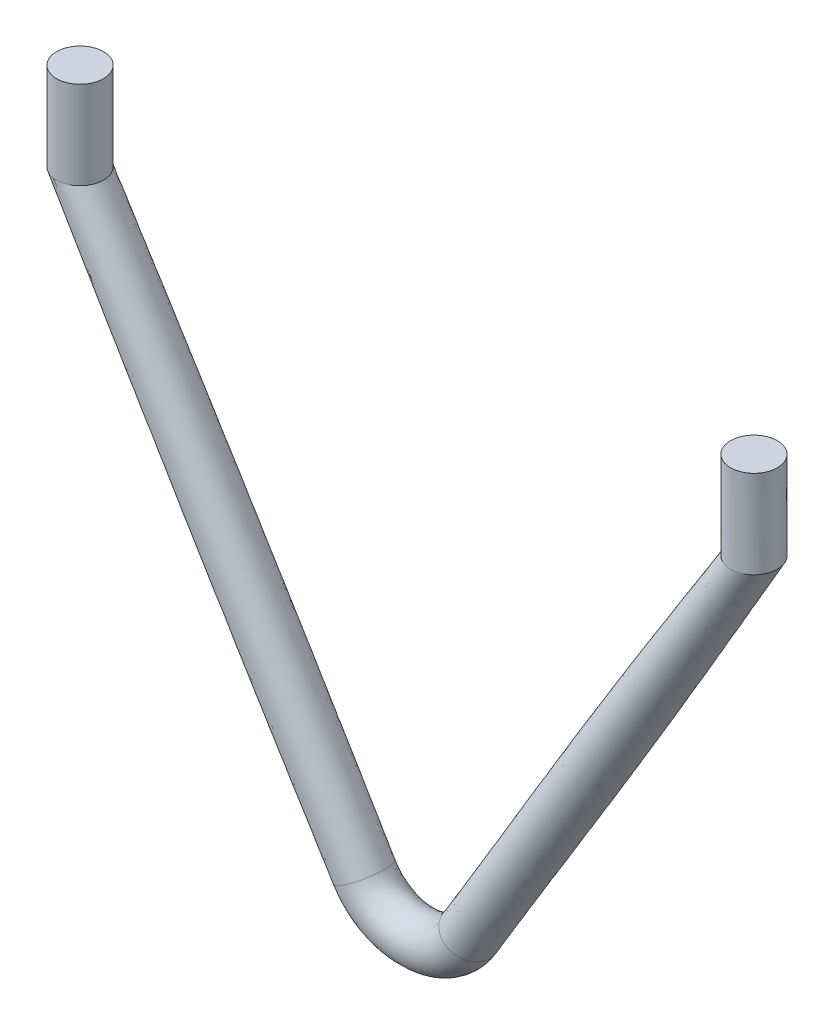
ISO-10303-21;
HEADER;
FILE_DESCRIPTION(('STEP AP214'),'2;1');
FILE_NAME('part.step','',(''),(''),'','','');
FILE_SCHEMA(('AUTOMOTIVE_DESIGN { 1 0 10303 214 1 1 1 1 }'));
ENDSEC;
DATA;
#1=APPLICATION_CONTEXT('core data for automotive mechanical design processes');
#2=APPLICATION_PROTOCOL_DEFINITION('international standard','automotive_design',2000,#1);
#3=PRODUCT_CONTEXT('',#1,'mechanical');
#4=PRODUCT('Part','Part','',(#3));
#5=PRODUCT_RELATED_PRODUCT_CATEGORY('part','',(#4));
#6=PRODUCT_DEFINITION_FORMATION('','',#4);
#7=PRODUCT_DEFINITION_CONTEXT('part definition',#1,'design');
#8=PRODUCT_DEFINITION('design','',#6,#7);
#9=PRODUCT_DEFINITION_SHAPE('','',#8);
#10=(LENGTH_UNIT() NAMED_UNIT(*) SI_UNIT(.MILLI.,.METRE.));
#11=(NAMED_UNIT(*) PLANE_ANGLE_UNIT() SI_UNIT($,.RADIAN.));
#12=(NAMED_UNIT(*) SI_UNIT($,.STERADIAN.) SOLID_ANGLE_UNIT());
#13=UNCERTAINTY_MEASURE_WITH_UNIT(LENGTH_MEASURE(1.E-05),#10,'distance_accuracy_value','');
#14=(GEOMETRIC_REPRESENTATION_CONTEXT(3) GLOBAL_UNCERTAINTY_ASSIGNED_CONTEXT((#13)) GLOBAL_UNIT_ASSIGNED_CONTEXT((#10,
#11,#12)) REPRESENTATION_CONTEXT('',''));
#15=CARTESIAN_POINT('',(0.,0.,0.));
#16=DIRECTION('',(0.,0.,1.));
#17=DIRECTION('',(1.,0.,0.));
#18=AXIS2_PLACEMENT_3D('',#15,#16,#17);
#19=CARTESIAN_POINT('',(84.4002244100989,95.,0.));
#20=DIRECTION('',(0.,1.,0.));
#21=DIRECTION('',(0.,0.,1.));
#22=AXIS2_PLACEMENT_3D('',#19,#20,#21);
#23=PLANE('',#22);
#24=CARTESIAN_POINT('',(84.4002244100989,95.,0.));
#25=DIRECTION('',(0.,1.,0.));
#26=DIRECTION('',(0.,0.,1.));
#27=AXIS2_PLACEMENT_3D('',#24,#25,#26);
#28=CIRCLE('',#27,4.00000000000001);
#29=CARTESIAN_POINT('',(81.2473219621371,95.,2.46154548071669));
#30=VERTEX_POINT('',#29);
#31=EDGE_CURVE('E11',#30,#30,#28,.T.);
#32=ORIENTED_EDGE('',*,*,#31,.T.);
#33=EDGE_LOOP('',(#32));
#34=FACE_BOUND('',#33,.T.);
#35=ADVANCED_FACE('F166',(#34),#23,.T.);
#36=CARTESIAN_POINT('',(81.2473219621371,95.,2.46154548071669));
#37=CARTESIAN_POINT('',(80.8499915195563,80.,1.84278225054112));
#38=CARTESIAN_POINT('',(76.3242310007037,95.,-3.84425941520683));
#39=CARTESIAN_POINT('',(77.164427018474,80.,-5.25768353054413));
#40=CARTESIAN_POINT('',(82.6300358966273,95.,-8.76735037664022));
#41=CARTESIAN_POINT('',(84.2648927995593,80.,-8.94324803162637));
#42=CARTESIAN_POINT('',(87.5531268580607,95.,-2.46154548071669));
#43=CARTESIAN_POINT('',(87.9504573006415,80.,-1.84278225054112));
#44=CARTESIAN_POINT('',(92.476217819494,95.,3.84425941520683));
#45=CARTESIAN_POINT('',(91.6360218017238,80.,5.25768353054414));
#46=CARTESIAN_POINT('',(86.1704129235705,95.,8.76735037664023));
#47=CARTESIAN_POINT('',(84.5355560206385,80.,8.94324803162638));
#48=CARTESIAN_POINT('',(81.2473219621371,95.,2.46154548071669));
#49=CARTESIAN_POINT('',(80.8499915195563,80.,1.84278225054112));
#50=(BOUNDED_SURFACE() B_SPLINE_SURFACE(3,1,((#36,#37),(#38,#39),(#40,#41),(#42,#43),(#44,#45),
(#46,#47),(#48,#49)),.UNSPECIFIED.,.T.,.F.,.F.) B_SPLINE_SURFACE_WITH_KNOTS((4,3,4),(2,2),(0.,
0.5,1.),(0.,1.),.UNSPECIFIED.) GEOMETRIC_REPRESENTATION_ITEM() RATIONAL_B_SPLINE_SURFACE(((1.,
1.),(0.333333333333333,0.333333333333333),(0.333333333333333,0.333333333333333),(1.,1.),
(0.333333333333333,0.333333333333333),(0.333333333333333,0.333333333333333),(1.,1.))) REPRESENTATION_ITEM('') SURFACE());
#51=CARTESIAN_POINT('',(84.4002244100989,80.,0.));
#52=DIRECTION('',(0.,1.,0.));
#53=DIRECTION('',(0.,0.,1.));
#54=AXIS2_PLACEMENT_3D('',#51,#52,#53);
#55=CIRCLE('',#54,4.00000000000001);
#56=CARTESIAN_POINT('',(80.8499915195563,80.,1.84278225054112));
#57=VERTEX_POINT('',#56);
#58=EDGE_CURVE('E182',#57,#57,#55,.T.);
#59=CARTESIAN_POINT('',(81.2473219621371,95.,2.46154548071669));
#60=CARTESIAN_POINT('',(81.2431831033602,94.84375,2.45510003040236));
#61=CARTESIAN_POINT('',(81.2390442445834,94.6875,2.44865458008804));
#62=CARTESIAN_POINT('',(81.2307665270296,94.375,2.43576367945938));
#63=CARTESIAN_POINT('',(81.2266276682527,94.21875,2.42931822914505));
#64=CARTESIAN_POINT('',(81.2183499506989,93.90625,2.41642732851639));
#65=CARTESIAN_POINT('',(81.2142110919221,93.75,2.40998187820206));
#66=CARTESIAN_POINT('',(81.2059333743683,93.4375,2.3970909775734));
#67=CARTESIAN_POINT('',(81.2017945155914,93.28125,2.39064552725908));
#68=CARTESIAN_POINT('',(81.1935167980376,92.96875,2.37775462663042));
#69=CARTESIAN_POINT('',(81.1893779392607,92.8125,2.37130917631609));
#70=CARTESIAN_POINT('',(81.181100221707,92.5,2.35841827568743));
#71=CARTESIAN_POINT('',(81.1769613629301,92.34375,2.3519728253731));
#72=CARTESIAN_POINT('',(81.1686836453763,92.03125,2.33908192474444));
#73=CARTESIAN_POINT('',(81.1645447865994,91.875,2.33263647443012));
#74=CARTESIAN_POINT('',(81.1562670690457,91.5625,2.31974557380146));
#75=CARTESIAN_POINT('',(81.1521282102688,91.40625,2.31330012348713));
#76=CARTESIAN_POINT('',(81.143850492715,91.09375,2.30040922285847));
#77=CARTESIAN_POINT('',(81.1397116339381,90.9375,2.29396377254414));
#78=CARTESIAN_POINT('',(81.1314339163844,90.625,2.28107287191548));
#79=CARTESIAN_POINT('',(81.1272950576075,90.46875,2.27462742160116));
#80=CARTESIAN_POINT('',(81.1190173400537,90.15625,2.2617365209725));
#81=CARTESIAN_POINT('',(81.1148784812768,90.,2.25529107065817));
#82=CARTESIAN_POINT('',(81.1066007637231,89.6875,2.24240017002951));
#83=CARTESIAN_POINT('',(81.1024619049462,89.53125,2.23595471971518));
#84=CARTESIAN_POINT('',(81.0941841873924,89.21875,2.22306381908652));
#85=CARTESIAN_POINT('',(81.0900453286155,89.0625,2.21661836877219));
#86=CARTESIAN_POINT('',(81.0817676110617,88.75,2.20372746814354));
#87=CARTESIAN_POINT('',(81.0776287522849,88.59375,2.19728201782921));
#88=CARTESIAN_POINT('',(81.0693510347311,88.28125,2.18439111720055));
#89=CARTESIAN_POINT('',(81.0652121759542,88.125,2.17794566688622));
#90=CARTESIAN_POINT('',(81.0569344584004,87.8125,2.16505476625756));
#91=CARTESIAN_POINT('',(81.0527955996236,87.65625,2.15860931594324));
#92=CARTESIAN_POINT('',(81.0445178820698,87.34375,2.14571841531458));
#93=CARTESIAN_POINT('',(81.0403790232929,87.1875,2.13927296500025));
#94=CARTESIAN_POINT('',(81.0321013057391,86.875,2.12638206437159));
#95=CARTESIAN_POINT('',(81.0279624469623,86.71875,2.11993661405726));
#96=CARTESIAN_POINT('',(81.0196847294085,86.40625,2.1070457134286));
#97=CARTESIAN_POINT('',(81.0155458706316,86.25,2.10060026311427));
#98=CARTESIAN_POINT('',(81.0072681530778,85.9375,2.08770936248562));
#99=CARTESIAN_POINT('',(81.003129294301,85.78125,2.08126391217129));
#100=CARTESIAN_POINT('',(80.9948515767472,85.46875,2.06837301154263));
#101=CARTESIAN_POINT('',(80.9907127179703,85.3125,2.0619275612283));
#102=CARTESIAN_POINT('',(80.9824350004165,85.,2.04903666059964));
#103=CARTESIAN_POINT('',(80.9782961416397,84.84375,2.04259121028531));
#104=CARTESIAN_POINT('',(80.9700184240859,84.53125,2.02970030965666));
#105=CARTESIAN_POINT('',(80.965879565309,84.375,2.02325485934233));
#106=CARTESIAN_POINT('',(80.9576018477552,84.0625,2.01036395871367));
#107=CARTESIAN_POINT('',(80.9534629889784,83.90625,2.00391850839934));
#108=CARTESIAN_POINT('',(80.9451852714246,83.59375,1.99102760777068));
#109=CARTESIAN_POINT('',(80.9410464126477,83.4375,1.98458215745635));
#110=CARTESIAN_POINT('',(80.9327686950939,83.125,1.9716912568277));
#111=CARTESIAN_POINT('',(80.928629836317,82.96875,1.96524580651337));
#112=CARTESIAN_POINT('',(80.9203521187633,82.65625,1.95235490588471));
#113=CARTESIAN_POINT('',(80.9162132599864,82.5,1.94590945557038));
#114=CARTESIAN_POINT('',(80.9079355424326,82.1875,1.93301855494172));
#115=CARTESIAN_POINT('',(80.9037966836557,82.03125,1.9265731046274));
#116=CARTESIAN_POINT('',(80.895518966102,81.71875,1.91368220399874));
#117=CARTESIAN_POINT('',(80.8913801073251,81.5625,1.90723675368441));
#118=CARTESIAN_POINT('',(80.8831023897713,81.25,1.89434585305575));
#119=CARTESIAN_POINT('',(80.8789635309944,81.09375,1.88790040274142));
#120=CARTESIAN_POINT('',(80.8706858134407,80.78125,1.87500950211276));
#121=CARTESIAN_POINT('',(80.8665469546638,80.625,1.86856405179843));
#122=CARTESIAN_POINT('',(80.85826923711,80.3125,1.85567315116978));
#123=CARTESIAN_POINT('',(80.8541303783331,80.15625,1.84922770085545));
#124=CARTESIAN_POINT('',(80.8499915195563,80.,1.84278225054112));
#125=B_SPLINE_CURVE_WITH_KNOTS('',3,(#59,#60,#61,#62,#63,#64,#65,#66,#67,#68,#69,#70,#71,#72,
#73,#74,#75,#76,#77,#78,#79,#80,#81,#82,#83,#84,#85,#86,#87,#88,#89,#90,#91,#92,#93,#94,#95,#96,
#97,#98,#99,#100,#101,#102,#103,#104,#105,#106,#107,#108,#109,#110,#111,#112,#113,#114,#115,
#116,#117,#118,#119,#120,#121,#122,#123,#124),.UNSPECIFIED.,.F.,.F.,(4,2,2,2,2,2,2,2,2,2,2,2,2,
2,2,2,2,2,2,2,2,2,2,2,2,2,2,2,2,2,2,2,4),(0.,0.469312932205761,0.938625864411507,
1.40793879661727,1.87725172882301,2.34656466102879,2.81587759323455,3.2851905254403,
3.75450345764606,4.22381638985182,4.69312932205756,5.16244225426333,5.63175518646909,
6.10106811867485,6.57038105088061,7.03969398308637,7.50900691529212,7.97831984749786,
8.44763277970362,8.91694571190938,9.38625864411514,9.8555715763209,10.3248845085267,
10.7941974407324,11.2635103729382,11.7328233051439,12.2021362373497,12.6714491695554,
13.1407621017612,13.610075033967,14.0793879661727,14.5487008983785,15.0180138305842),.UNSPECIFIED.);
#126=EDGE_CURVE('BSEAM168',#30,#57,#125,.T.);
#127=ORIENTED_EDGE('',*,*,#31,.F.);
#128=ORIENTED_EDGE('',*,*,#58,.T.);
#129=ORIENTED_EDGE('',*,*,#126,.T.);
#130=ORIENTED_EDGE('',*,*,#126,.F.);
#131=EDGE_LOOP('',(#127,#129,#128,#130));
#132=FACE_BOUND('',#131,.T.);
#133=ADVANCED_FACE('F168',(#132),#50,.T.);
#134=CARTESIAN_POINT('',(35.4502558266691,0.272793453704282,3.96523795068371));
#135=CARTESIAN_POINT('',(44.375986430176,13.0907731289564,3.92809047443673));
#136=CARTESIAN_POINT('',(61.4707224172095,39.0997664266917,3.89296686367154));
#137=CARTESIAN_POINT('',(77.291929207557,66.2422441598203,3.93624538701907));
#138=CARTESIAN_POINT('',(84.8241699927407,80.,3.97747031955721));
#139=CARTESIAN_POINT('',(35.8941076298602,0.00370829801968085,4.03411755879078));
#140=CARTESIAN_POINT('',(44.8268869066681,12.8176765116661,3.86906001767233));
#141=CARTESIAN_POINT('',(61.8701206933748,38.7520957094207,3.68539183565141));
#142=CARTESIAN_POINT('',(77.794030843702,66.1485468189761,3.79429472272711));
#143=CARTESIAN_POINT('',(85.3448196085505,80.,3.92197597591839));
#144=CARTESIAN_POINT('',(36.8050602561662,-0.548556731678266,3.96559046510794));
#145=CARTESIAN_POINT('',(45.7078136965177,12.2841737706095,3.54627865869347));
#146=CARTESIAN_POINT('',(62.5999596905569,38.1030389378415,3.06825692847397));
#147=CARTESIAN_POINT('',(78.7470268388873,65.9832073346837,3.30529281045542));
#148=CARTESIAN_POINT('',(86.3638817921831,79.9999999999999,3.60410874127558));
#149=CARTESIAN_POINT('',(38.0339117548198,-1.29354795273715,3.25869169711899));
#150=CARTESIAN_POINT('',(46.7654595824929,11.643434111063,2.52102133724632));
#151=CARTESIAN_POINT('',(63.3218267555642,37.4163061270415,1.67566380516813));
#152=CARTESIAN_POINT('',(79.8052755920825,65.8391338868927,2.06735597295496));
#153=CARTESIAN_POINT('',(87.5936352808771,80.0000000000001,2.57819444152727));
#154=CARTESIAN_POINT('',(38.9378623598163,-1.84156800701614,2.05583947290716));
#155=CARTESIAN_POINT('',(47.3983298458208,11.2595721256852,1.11197277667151));
#156=CARTESIAN_POINT('',(63.560832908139,37.1212588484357,0.028374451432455));
#157=CARTESIAN_POINT('',(80.331209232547,65.8206171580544,0.514706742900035));
#158=CARTESIAN_POINT('',(88.3371815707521,80.,1.15994021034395));
#159=CARTESIAN_POINT('',(39.3794048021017,-2.10925311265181,0.539905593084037));
#160=CARTESIAN_POINT('',(47.5106891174,11.1907449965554,-0.466106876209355));
#161=CARTESIAN_POINT('',(63.2799993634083,37.2630664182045,-1.62375721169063));
#162=CARTESIAN_POINT('',(80.2453454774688,65.930247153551,-1.11605242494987));
#163=CARTESIAN_POINT('',(88.4813893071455,80.,-0.435012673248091));
#164=CARTESIAN_POINT('',(39.2912408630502,-2.05580372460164,-1.05816696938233));
#165=CARTESIAN_POINT('',(47.0860935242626,11.4473409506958,-1.97260653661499));
#166=CARTESIAN_POINT('',(62.521389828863,37.8202591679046,-3.02915269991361));
#167=CARTESIAN_POINT('',(79.5614349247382,66.1512100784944,-2.57627811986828));
#168=CARTESIAN_POINT('',(88.0042529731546,80.0000000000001,-1.96367435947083));
#169=CARTESIAN_POINT('',(38.6868372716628,-1.6893840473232,-2.49518403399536));
#170=CARTESIAN_POINT('',(46.189644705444,11.9903634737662,-3.17857280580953));
#171=CARTESIAN_POINT('',(61.400046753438,38.707928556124,-3.97369253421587));
#172=CARTESIAN_POINT('',(78.3840464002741,66.449952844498,-3.64406837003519));
#173=CARTESIAN_POINT('',(86.9784398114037,80.0000000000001,-3.19342737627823));
#174=CARTESIAN_POINT('',(37.6582034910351,-1.0657748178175,-3.55225840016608));
#175=CARTESIAN_POINT('',(44.9577693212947,12.7373561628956,-3.90089339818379));
#176=CARTESIAN_POINT('',(60.0868012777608,39.7906762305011,-4.3128921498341));
#177=CARTESIAN_POINT('',(76.8923945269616,66.7812060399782,-4.15734800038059));
#178=CARTESIAN_POINT('',(85.5601413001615,79.9999999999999,-3.93694030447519));
#179=CARTESIAN_POINT('',(36.3619244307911,-0.279905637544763,-4.06861836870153));
#180=CARTESIAN_POINT('',(43.5774163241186,13.5748735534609,-4.03031073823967));
#181=CARTESIAN_POINT('',(58.7820542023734,40.90347115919,-3.99467611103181));
#182=CARTESIAN_POINT('',(75.3129506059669,67.0948106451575,-4.03867826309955));
#183=CARTESIAN_POINT('',(83.9652258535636,80.0000000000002,-4.08116965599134));
#184=CARTESIAN_POINT('',(34.9953476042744,0.548581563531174,-3.96549648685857));
#185=CARTESIAN_POINT('',(42.2580462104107,14.3755294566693,-3.54717802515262));
#186=CARTESIAN_POINT('',(57.6852262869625,41.8767144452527,-3.06711990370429));
#187=CARTESIAN_POINT('',(73.8855095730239,67.3431417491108,-3.30618444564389));
#188=CARTESIAN_POINT('',(82.436542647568,79.9999999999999,-3.60400611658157));
#189=CARTESIAN_POINT('',(33.7665575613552,1.29353552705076,-3.25874280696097));
#190=CARTESIAN_POINT('',(41.2000470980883,15.0173746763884,-2.52493011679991));
#191=CARTESIAN_POINT('',(56.9637293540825,42.5623210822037,-1.67188409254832));
#192=CARTESIAN_POINT('',(72.8268919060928,67.4883509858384,-2.07126808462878));
#193=CARTESIAN_POINT('',(81.2068247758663,80.0000000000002,-2.57824976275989));
#194=CARTESIAN_POINT('',(32.8625764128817,1.84157409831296,-2.05580601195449));
#195=CARTESIAN_POINT('',(40.5645352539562,15.4024726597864,-1.11842109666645));
#196=CARTESIAN_POINT('',(56.7273651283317,42.8561359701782,-0.0218447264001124));
#197=CARTESIAN_POINT('',(72.2983268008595,67.5080899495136,-0.521153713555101));
#198=CARTESIAN_POINT('',(80.4632637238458,79.9999999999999,-1.15990492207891));
#199=CARTESIAN_POINT('',(32.421047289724,2.10925112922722,-0.539934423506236));
#200=CARTESIAN_POINT('',(40.448836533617,15.471916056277,0.458710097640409));
#201=CARTESIAN_POINT('',(57.0115193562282,42.7137232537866,1.6310892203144));
#202=CARTESIAN_POINT('',(72.3808426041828,67.3990818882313,1.10865558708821));
#203=CARTESIAN_POINT('',(80.319056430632,80.0000000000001,0.434983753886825));
#204=CARTESIAN_POINT('',(32.5092101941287,2.05580236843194,1.05820233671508));
#205=CARTESIAN_POINT('',(40.8713562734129,15.2149514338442,1.9666702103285));
#206=CARTESIAN_POINT('',(57.7722497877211,42.1568688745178,3.03516218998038));
#207=CARTESIAN_POINT('',(73.0626873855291,67.1777501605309,2.5703405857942));
#208=CARTESIAN_POINT('',(80.7962067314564,79.9999999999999,1.96370811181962));
#209=CARTESIAN_POINT('',(33.1136031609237,1.68938913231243,2.49512844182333));
#210=CARTESIAN_POINT('',(41.7681545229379,14.6708243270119,3.17539076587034));
#211=CARTESIAN_POINT('',(58.8931553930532,41.2703650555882,3.97676458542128));
#212=CARTESIAN_POINT('',(74.2404096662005,66.8778970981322,3.64088944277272));
#213=CARTESIAN_POINT('',(81.8219863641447,80.0000000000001,3.19337566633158));
#214=CARTESIAN_POINT('',(34.1422639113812,1.06576355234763,3.55236161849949));
#215=CARTESIAN_POINT('',(43.0027253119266,13.9225628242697,3.90051020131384));
#216=CARTESIAN_POINT('',(60.2038741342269,40.1887670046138,4.31347523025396));
#217=CARTESIAN_POINT('',(75.7347859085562,66.5453913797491,4.15695747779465));
#218=CARTESIAN_POINT('',(83.2403529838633,80.,3.937035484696));
#219=CARTESIAN_POINT('',(35.006404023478,0.541878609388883,3.89635834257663));
#220=CARTESIAN_POINT('',(43.9250859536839,13.3638697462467,3.98712093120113));
#221=CARTESIAN_POINT('',(61.0713241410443,39.4474371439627,4.10054189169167));
#222=CARTESIAN_POINT('',(76.789827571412,66.3359415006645,4.07819605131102));
#223=CARTESIAN_POINT('',(84.3035203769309,80.,4.03296466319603));
#224=CARTESIAN_POINT('',(35.4502558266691,0.272793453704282,3.96523795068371));
#225=CARTESIAN_POINT('',(44.375986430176,13.0907731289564,3.92809047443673));
#226=CARTESIAN_POINT('',(61.4707224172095,39.0997664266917,3.89296686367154));
#227=CARTESIAN_POINT('',(77.291929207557,66.2422441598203,3.93624538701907));
#228=CARTESIAN_POINT('',(84.8241699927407,80.,3.97747031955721));
#229=B_SPLINE_SURFACE_WITH_KNOTS('',3,3,((#134,#135,#136,#137,#138),(#139,#140,#141,#142,#143),
(#144,#145,#146,#147,#148),(#149,#150,#151,#152,#153),(#154,#155,#156,#157,#158),(#159,#160,
#161,#162,#163),(#164,#165,#166,#167,#168),(#169,#170,#171,#172,#173),(#174,#175,#176,#177,
#178),(#179,#180,#181,#182,#183),(#184,#185,#186,#187,#188),(#189,#190,#191,#192,#193),(#194,
#195,#196,#197,#198),(#199,#200,#201,#202,#203),(#204,#205,#206,#207,#208),(#209,#210,#211,#212,
#213),(#214,#215,#216,#217,#218),(#219,#220,#221,#222,#223),(#224,#225,#226,#227,#228)),
.UNSPECIFIED.,.T.,.F.,.F.,(4,1,1,1,1,1,1,1,1,1,1,1,1,1,1,1,4),(4,1,4),(0.,0.0625,0.125,0.1875,
0.25,0.3125,0.375,0.4375,0.5,0.5625,0.625,0.6875,0.75,0.8125,0.875,0.9375,1.),(0.,
0.500127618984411,1.),.UNSPECIFIED.);
#230=CARTESIAN_POINT('',(35.9002244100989,0.,0.));
#231=DIRECTION('',(-0.518420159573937,-0.855126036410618,0.));
#232=DIRECTION('',(0.855126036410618,-0.518420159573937,0.));
#233=AXIS2_PLACEMENT_3D('',#230,#231,#232);
#234=CIRCLE('',#233,4.);
#235=CARTESIAN_POINT('',(35.9775877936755,-0.0469015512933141,3.99897676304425));
#236=VERTEX_POINT('',#235);
#237=EDGE_CURVE('E177',#236,#236,#234,.T.);
#238=ORIENTED_EDGE('',*,*,#237,.F.);
#239=EDGE_LOOP('',(#238));
#240=FACE_BOUND('',#239,.T.);
#241=ORIENTED_EDGE('',*,*,#58,.F.);
#242=EDGE_LOOP('',(#241));
#243=FACE_BOUND('',#242,.T.);
#244=ADVANCED_FACE('F196',(#240,#243),#229,.T.);
#245=CARTESIAN_POINT('',(35.9775877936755,-0.0469015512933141,3.99897676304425));
#246=CARTESIAN_POINT('',(31.9141067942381,-6.74955062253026,3.99897676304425));
#247=CARTESIAN_POINT('',(21.9529595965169,-6.70916372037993,3.99998026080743));
#248=CARTESIAN_POINT('',(17.8894785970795,-0.00651464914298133,3.99998026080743));
#249=CARTESIAN_POINT('',(35.8832205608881,0.0103085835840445,4.00147335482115));
#250=CARTESIAN_POINT('',(31.8619138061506,-6.62277472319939,4.00147335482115));
#251=CARTESIAN_POINT('',(22.0051762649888,-6.582373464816,4.00032703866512));
#252=CARTESIAN_POINT('',(17.9838695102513,0.0507098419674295,4.00032703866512));
#253=CARTESIAN_POINT('',(35.6960880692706,0.123757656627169,3.99746016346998));
#254=CARTESIAN_POINT('',(31.7591740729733,-6.37012110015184,3.99746016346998));
#255=CARTESIAN_POINT('',(22.1078136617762,-6.32978188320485,3.99205241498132));
#256=CARTESIAN_POINT('',(18.1708996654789,0.164096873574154,3.99205241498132));
#257=CARTESIAN_POINT('',(35.4210981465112,0.290470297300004,3.96543039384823));
#258=CARTESIAN_POINT('',(31.6074631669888,-6.0000616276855,3.96543039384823));
#259=CARTESIAN_POINT('',(22.2589389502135,-5.9600774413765,3.95376545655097));
#260=CARTESIAN_POINT('',(18.4453039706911,0.330454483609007,3.95376545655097));
#261=CARTESIAN_POINT('',(35.1527199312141,0.453174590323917,3.90839978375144));
#262=CARTESIAN_POINT('',(31.4594970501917,-5.63873944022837,3.90839978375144));
#263=CARTESIAN_POINT('',(22.4059043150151,-5.5993619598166,3.89063299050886));
#264=CARTESIAN_POINT('',(18.7126814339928,0.492552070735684,3.89063299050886));
#265=CARTESIAN_POINT('',(33.5875382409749,1.40206599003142,3.42226593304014));
#266=CARTESIAN_POINT('',(30.5951401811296,-3.53384833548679,3.42226593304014));
#267=CARTESIAN_POINT('',(23.2618677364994,-3.49955938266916,3.36894224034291));
#268=CARTESIAN_POINT('',(20.269469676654,1.43635494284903,3.36894224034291));
#269=CARTESIAN_POINT('',(32.5147536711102,2.0524416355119,1.85614639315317));
#270=CARTESIAN_POINT('',(30.0157529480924,-2.0696214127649,1.85614639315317));
#271=CARTESIAN_POINT('',(23.8149677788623,-2.05126906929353,1.77868566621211));
#272=CARTESIAN_POINT('',(21.3159670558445,2.07079397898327,1.77868566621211));
#273=CARTESIAN_POINT('',(32.4378972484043,2.09903584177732,-2.1166251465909));
#274=CARTESIAN_POINT('',(29.9206397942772,-2.05314140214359,-2.1166251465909));
#275=CARTESIAN_POINT('',(23.8438999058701,-2.07491130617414,-2.19508279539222));
#276=CARTESIAN_POINT('',(21.3266424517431,2.07726593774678,-2.19508279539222));
#277=CARTESIAN_POINT('',(33.9355163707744,1.19110424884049,-3.9490449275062));
#278=CARTESIAN_POINT('',(30.6698536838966,-4.19555585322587,-3.9490449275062));
#279=CARTESIAN_POINT('',(23.0644511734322,-4.23565563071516,-3.99304470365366));
#280=CARTESIAN_POINT('',(19.7987884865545,1.1510044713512,-3.99304470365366));
#281=CARTESIAN_POINT('',(37.7102056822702,-1.09730114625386,-4.0489085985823));
#282=CARTESIAN_POINT('',(32.9280806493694,-8.98534243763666,-4.0489085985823));
#283=CARTESIAN_POINT('',(20.8052769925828,-9.02601646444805,-4.00691581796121));
#284=CARTESIAN_POINT('',(16.023151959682,-1.13797517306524,-4.00691581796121));
#285=CARTESIAN_POINT('',(39.2771555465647,-2.04726450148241,-2.29756545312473));
#286=CARTESIAN_POINT('',(33.7269734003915,-11.2022041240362,-2.29756545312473));
#287=CARTESIAN_POINT('',(20.0358500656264,-11.2250144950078,-2.22021549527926));
#288=CARTESIAN_POINT('',(14.4856679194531,-2.07007487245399,-2.22021549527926));
#289=CARTESIAN_POINT('',(39.3540119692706,-2.09385870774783,1.67520608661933));
#290=CARTESIAN_POINT('',(33.7495669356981,-11.3383041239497,1.67520608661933));
#291=CARTESIAN_POINT('',(20.0794375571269,-11.3209922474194,1.75355296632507));
#292=CARTESIAN_POINT('',(14.4749925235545,-2.0765468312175,1.75355296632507));
#293=CARTESIAN_POINT('',(38.3428896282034,-1.48086578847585,3.29645773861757));
#294=CARTESIAN_POINT('',(33.2145999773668,-9.93990026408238,3.29645773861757));
#295=CARTESIAN_POINT('',(20.6412146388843,-9.90633475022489,3.35146741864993));
#296=CARTESIAN_POINT('',(15.5129249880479,-1.4473002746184,3.35146741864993));
#297=CARTESIAN_POINT('',(36.7981089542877,-0.544342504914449,3.86486915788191));
#298=CARTESIAN_POINT('',(32.3654801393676,-7.85589518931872,3.86486915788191));
#299=CARTESIAN_POINT('',(21.4995083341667,-7.81676802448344,3.88458656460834));
#300=CARTESIAN_POINT('',(17.0668795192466,-0.505215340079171,3.88458656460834));
#301=CARTESIAN_POINT('',(36.5322107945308,-0.383141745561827,3.93603465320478));
#302=CARTESIAN_POINT('',(32.2193595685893,-7.49712314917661,3.93603465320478));
#303=CARTESIAN_POINT('',(21.6467637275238,-7.45730799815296,3.94968237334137));
#304=CARTESIAN_POINT('',(17.3339125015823,-0.343326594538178,3.94968237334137));
#305=CARTESIAN_POINT('',(36.2587408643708,-0.217350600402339,3.98257454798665));
#306=CARTESIAN_POINT('',(32.0687813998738,-7.12862394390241,3.98257454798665));
#307=CARTESIAN_POINT('',(21.7980651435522,-7.08837032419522,3.98998479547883));
#308=CARTESIAN_POINT('',(17.6081056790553,-0.177096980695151,3.98998479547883));
#309=CARTESIAN_POINT('',(36.0719550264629,-0.104111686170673,3.99648017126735));
#310=CARTESIAN_POINT('',(31.9662997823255,-6.87632652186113,3.99648017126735));
#311=CARTESIAN_POINT('',(21.9007429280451,-6.83595397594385,3.99963348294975));
#312=CARTESIAN_POINT('',(17.7950876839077,-0.0637391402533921,3.99963348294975));
#313=CARTESIAN_POINT('',(35.9775877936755,-0.0469015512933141,3.99897676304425));
#314=CARTESIAN_POINT('',(31.9141067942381,-6.74955062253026,3.99897676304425));
#315=CARTESIAN_POINT('',(21.9529595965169,-6.70916372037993,3.99998026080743));
#316=CARTESIAN_POINT('',(17.8894785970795,-0.00651464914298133,3.99998026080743));
#317=B_SPLINE_SURFACE_WITH_KNOTS('',3,3,((#245,#246,#247,#248),(#249,#250,#251,#252),(#253,#254,
#255,#256),(#257,#258,#259,#260),(#261,#262,#263,#264),(#265,#266,#267,#268),(#269,#270,#271,
#272),(#273,#274,#275,#276),(#277,#278,#279,#280),(#281,#282,#283,#284),(#285,#286,#287,#288),
(#289,#290,#291,#292),(#293,#294,#295,#296),(#297,#298,#299,#300),(#301,#302,#303,#304),(#305,
#306,#307,#308),(#309,#310,#311,#312),(#313,#314,#315,#316)),.UNSPECIFIED.,.T.,.F.,.F.,(4,1,1,1,
1,2,2,2,1,1,1,1,4),(4,4),(0.,0.0125,0.0249999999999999,0.0375000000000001,0.05,0.25,0.5,0.75,
0.95,0.9625,0.975,0.9875,1.),(0.,1.),.UNSPECIFIED.);
#318=CARTESIAN_POINT('',(17.9002244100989,0.,0.));
#319=DIRECTION('',(-0.518420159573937,0.855126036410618,0.));
#320=DIRECTION('',(-0.855126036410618,-0.518420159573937,0.));
#321=AXIS2_PLACEMENT_3D('',#318,#319,#320);
#322=CIRCLE('',#321,4.);
#323=CARTESIAN_POINT('',(17.8894785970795,-0.00651464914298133,3.99998026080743));
#324=VERTEX_POINT('',#323);
#325=EDGE_CURVE('E233',#324,#324,#322,.T.);
#326=CARTESIAN_POINT('',(35.9775877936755,-0.0469015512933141,3.99897676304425));
#327=CARTESIAN_POINT('',(35.969656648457,-0.0599838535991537,3.99897676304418));
#328=CARTESIAN_POINT('',(35.9616976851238,-0.0730492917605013,3.99897676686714));
#329=CARTESIAN_POINT('',(35.9457348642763,-0.0991286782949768,3.99897678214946));
#330=CARTESIAN_POINT('',(35.9377310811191,-0.112142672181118,3.9989767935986));
#331=CARTESIAN_POINT('',(35.9216787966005,-0.138119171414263,3.99897682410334));
#332=CARTESIAN_POINT('',(35.9136303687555,-0.151081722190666,3.99897684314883));
#333=CARTESIAN_POINT('',(35.8974889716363,-0.176955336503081,3.99897688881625));
#334=CARTESIAN_POINT('',(35.8893960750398,-0.189866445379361,3.99897691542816));
#335=CARTESIAN_POINT('',(35.8731659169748,-0.215637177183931,3.99897697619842));
#336=CARTESIAN_POINT('',(35.8650287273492,-0.228496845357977,3.99897701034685));
#337=CARTESIAN_POINT('',(35.8487101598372,-0.254164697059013,3.99897708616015));
#338=CARTESIAN_POINT('',(35.8405288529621,-0.266972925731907,3.99897712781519));
#339=CARTESIAN_POINT('',(35.8241222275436,-0.292537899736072,3.9989772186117));
#340=CARTESIAN_POINT('',(35.8158969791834,-0.305294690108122,3.99897726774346));
#341=CARTESIAN_POINT('',(35.7994026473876,-0.330756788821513,3.99897737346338));
#342=CARTESIAN_POINT('',(35.7911336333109,-0.343462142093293,3.99897743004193));
#343=CARTESIAN_POINT('',(35.7745519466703,-0.368821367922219,3.99897755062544));
#344=CARTESIAN_POINT('',(35.7662393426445,-0.381475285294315,3.99897761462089));
#345=CARTESIAN_POINT('',(35.7495706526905,-0.406731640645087,3.99897775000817));
#346=CARTESIAN_POINT('',(35.7412146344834,-0.419334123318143,3.99897782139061));
#347=CARTESIAN_POINT('',(35.7244592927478,-0.444487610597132,3.99897797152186));
#348=CARTESIAN_POINT('',(35.7160600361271,-0.457038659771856,3.99897805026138));
#349=CARTESIAN_POINT('',(35.6992183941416,-0.482089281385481,3.99897821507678));
#350=CARTESIAN_POINT('',(35.6907760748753,-0.494588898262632,3.99897830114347));
#351=CARTESIAN_POINT('',(35.6738484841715,-0.519536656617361,3.99897848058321));
#352=CARTESIAN_POINT('',(35.6653632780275,-0.531984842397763,3.99897857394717));
#353=CARTESIAN_POINT('',(35.6483500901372,-0.55682973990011,3.99897876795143));
#354=CARTESIAN_POINT('',(35.6398221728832,-0.569226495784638,3.99897886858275));
#355=CARTESIAN_POINT('',(35.6227237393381,-0.593968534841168,3.99897907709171));
#356=CARTESIAN_POINT('',(35.6141532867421,-0.606313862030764,3.99897918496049));
#357=CARTESIAN_POINT('',(35.5969699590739,-0.630953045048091,3.99897940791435));
#358=CARTESIAN_POINT('',(35.588357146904,-0.643246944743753,3.99897952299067));
#359=CARTESIAN_POINT('',(35.5710892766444,-0.667783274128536,3.99897976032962));
#360=CARTESIAN_POINT('',(35.5624342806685,-0.680025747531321,3.99897988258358));
#361=CARTESIAN_POINT('',(35.5450822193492,-0.704459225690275,3.9989801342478));
#362=CARTESIAN_POINT('',(35.5363852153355,-0.716650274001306,3.99898026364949));
#363=CARTESIAN_POINT('',(35.518949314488,-0.740980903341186,3.99898052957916));
#364=CARTESIAN_POINT('',(35.5102104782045,-0.753120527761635,3.99898066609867));
#365=CARTESIAN_POINT('',(35.4926910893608,-0.777348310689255,3.99898094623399));
#366=CARTESIAN_POINT('',(35.4839105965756,-0.789436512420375,3.99898108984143));
#367=CARTESIAN_POINT('',(35.4663080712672,-0.813561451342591,3.99898138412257));
#368=CARTESIAN_POINT('',(35.4574860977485,-0.825598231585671,3.99898153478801));
#369=CARTESIAN_POINT('',(35.4398007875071,-0.84962032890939,3.99898184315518));
#370=CARTESIAN_POINT('',(35.430937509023,-0.861605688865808,3.99898200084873));
#371=CARTESIAN_POINT('',(35.4131697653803,-0.885524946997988,3.99898232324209));
#372=CARTESIAN_POINT('',(35.4042653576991,-0.89745888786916,3.99898248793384));
#373=CARTESIAN_POINT('',(35.3864155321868,-0.921275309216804,3.99898282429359));
#374=CARTESIAN_POINT('',(35.3774701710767,-0.933157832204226,3.99898299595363));
#375=CARTESIAN_POINT('',(35.3595386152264,-0.956871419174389,3.99898334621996));
#376=CARTESIAN_POINT('',(35.3505524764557,-0.968702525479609,3.99898352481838));
#377=CARTESIAN_POINT('',(35.332539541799,-0.992313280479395,3.99898388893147));
#378=CARTESIAN_POINT('',(35.323512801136,-1.00409297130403,3.99898407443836));
#379=CARTESIAN_POINT('',(35.3054188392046,-1.02760089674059,3.9989844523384));
#380=CARTESIAN_POINT('',(35.2963516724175,-1.03932917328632,3.99898464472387));
#381=CARTESIAN_POINT('',(35.2781770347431,-1.06273427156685,3.99898503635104));
#382=CARTESIAN_POINT('',(35.2690696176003,-1.07441113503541,3.99898523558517));
#383=CARTESIAN_POINT('',(35.2508146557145,-1.09771340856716,3.99898564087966));
#384=CARTESIAN_POINT('',(35.2416671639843,-1.10933886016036,3.99898584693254));
#385=CARTESIAN_POINT('',(35.2233322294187,-1.13253831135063,3.99898626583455));
#386=CARTESIAN_POINT('',(35.2141448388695,-1.14411235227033,3.99898647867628));
#387=CARTESIAN_POINT('',(35.1957302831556,-1.16720898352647,3.99898691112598));
#388=CARTESIAN_POINT('',(35.1865031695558,-1.1787316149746,3.99898713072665));
#389=CARTESIAN_POINT('',(35.1680093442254,-1.20172542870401,3.99898757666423));
#390=CARTESIAN_POINT('',(35.1587426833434,-1.21319665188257,3.99898780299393));
#391=CARTESIAN_POINT('',(35.1401699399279,-1.23608765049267,3.99898826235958));
#392=CARTESIAN_POINT('',(35.1308639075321,-1.24750746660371,3.99898849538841));
#393=CARTESIAN_POINT('',(35.112212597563,-1.270295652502,3.99898896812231));
#394=CARTESIAN_POINT('',(35.102867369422,-1.28166406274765,3.99898920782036));
#395=CARTESIAN_POINT('',(35.0841378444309,-1.30434943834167,3.99898969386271));
#396=CARTESIAN_POINT('',(35.074753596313,-1.31566644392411,3.99898994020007));
#397=CARTESIAN_POINT('',(35.0559462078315,-1.33824901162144,3.99899043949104));
#398=CARTESIAN_POINT('',(35.0465231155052,-1.34951461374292,3.99899069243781));
#399=CARTESIAN_POINT('',(35.0276382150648,-1.37199437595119,3.99899120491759));
#400=CARTESIAN_POINT('',(35.0181764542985,-1.38320857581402,3.99899146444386));
#401=CARTESIAN_POINT('',(34.9992143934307,-1.4055855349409,3.99899199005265));
#402=CARTESIAN_POINT('',(34.9897141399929,-1.41674833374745,3.99899225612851));
#403=CARTESIAN_POINT('',(34.9706752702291,-1.43902249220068,3.99899279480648));
#404=CARTESIAN_POINT('',(34.9611366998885,-1.4501338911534,3.99899306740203));
#405=CARTESIAN_POINT('',(34.9420213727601,-1.47230525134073,3.99899361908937));
#406=CARTESIAN_POINT('',(34.932444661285,-1.48336525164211,3.99899389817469));
#407=CARTESIAN_POINT('',(34.9132532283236,-1.50543381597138,3.99899446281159));
#408=CARTESIAN_POINT('',(34.9036385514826,-1.51644241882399,3.99899474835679));
#409=CARTESIAN_POINT('',(34.8843713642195,-1.53840818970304,3.99899532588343));
#410=CARTESIAN_POINT('',(34.8747188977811,-1.5493653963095,3.99899561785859));
#411=CARTESIAN_POINT('',(34.8553763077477,-1.57122837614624,3.99899620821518));
#412=CARTESIAN_POINT('',(34.8456862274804,-1.58213418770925,3.99899650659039));
#413=CARTESIAN_POINT('',(34.8262685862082,-1.60389437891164,3.99899710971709));
#414=CARTESIAN_POINT('',(34.8165410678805,-1.61474879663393,3.99899741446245));
#415=CARTESIAN_POINT('',(34.7970487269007,-1.63640620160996,3.99899803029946));
#416=CARTESIAN_POINT('',(34.7872839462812,-1.64720922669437,3.99899834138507));
#417=CARTESIAN_POINT('',(34.7677172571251,-1.66876384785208,3.99899896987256));
#418=CARTESIAN_POINT('',(34.7579153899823,-1.67951548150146,3.99899928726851));
#419=CARTESIAN_POINT('',(34.7382747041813,-1.70096732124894,3.99899992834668));
#420=CARTESIAN_POINT('',(34.7284359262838,-1.71166756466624,3.99900025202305));
#421=CARTESIAN_POINT('',(34.7087215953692,-1.73301662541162,3.99900090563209));
#422=CARTESIAN_POINT('',(34.6988460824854,-1.74366547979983,3.99900123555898));
#423=CARTESIAN_POINT('',(34.6790584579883,-1.76491176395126,3.99900190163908));
#424=CARTESIAN_POINT('',(34.6691463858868,-1.77550923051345,3.99900223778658));
#425=CARTESIAN_POINT('',(34.6492858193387,-1.79665274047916,3.99900291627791));
#426=CARTESIAN_POINT('',(34.6393373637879,-1.80719882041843,3.99900325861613));
#427=CARTESIAN_POINT('',(34.6194042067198,-1.82823955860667,3.99900394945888));
#428=CARTESIAN_POINT('',(34.6094195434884,-1.83873425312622,3.99900429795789));
#429=CARTESIAN_POINT('',(34.5894141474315,-1.85967222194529,3.99900500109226));
#430=CARTESIAN_POINT('',(34.5793934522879,-1.87011553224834,3.99900535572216));
#431=CARTESIAN_POINT('',(34.5593161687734,-1.89095073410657,3.99900607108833));
#432=CARTESIAN_POINT('',(34.5492596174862,-1.90134266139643,3.99900643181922));
#433=CARTESIAN_POINT('',(34.5291107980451,-1.92207509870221,3.99900715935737));
#434=CARTESIAN_POINT('',(34.5190185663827,-1.93241564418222,3.99900752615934));
#435=CARTESIAN_POINT('',(34.4987985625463,-1.95304531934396,3.99900826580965));
#436=CARTESIAN_POINT('',(34.4886708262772,-1.96333448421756,3.9990086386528));
#437=CARTESIAN_POINT('',(34.4683799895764,-1.98386139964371,3.99900939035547));
#438=CARTESIAN_POINT('',(34.4582169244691,-1.99409918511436,3.99900976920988));
#439=CARTESIAN_POINT('',(34.4378556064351,-2.01452334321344,3.99901053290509));
#440=CARTESIAN_POINT('',(34.4276573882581,-2.02470975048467,3.99901091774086));
#441=CARTESIAN_POINT('',(34.4072259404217,-2.0450311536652,3.99901169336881));
#442=CARTESIAN_POINT('',(34.3969927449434,-2.05516618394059,3.99901208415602));
#443=CARTESIAN_POINT('',(34.3764915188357,-2.07538483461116,3.99901287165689));
#444=CARTESIAN_POINT('',(34.3662235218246,-2.08546848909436,3.99901326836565));
#445=CARTESIAN_POINT('',(34.3456528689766,-2.10558438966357,3.99901406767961));
#446=CARTESIAN_POINT('',(34.335350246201,-2.11561666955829,3.99901447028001));
#447=CARTESIAN_POINT('',(34.3147105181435,-2.1356298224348,3.99901528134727));
#448=CARTESIAN_POINT('',(34.304373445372,-2.14561072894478,3.99901568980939));
#449=CARTESIAN_POINT('',(34.283664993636,-2.16552113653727,3.99901651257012));
#450=CARTESIAN_POINT('',(34.2732936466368,-2.17545067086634,3.99901692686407));
#451=CARTESIAN_POINT('',(34.2525168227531,-2.19525833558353,3.99901776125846));
#452=CARTESIAN_POINT('',(34.2421113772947,-2.20513649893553,3.99901818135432));
#453=CARTESIAN_POINT('',(34.2212665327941,-2.22484142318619,3.99901902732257));
#454=CARTESIAN_POINT('',(34.2108271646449,-2.23466821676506,3.99901945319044));
#455=CARTESIAN_POINT('',(34.1899146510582,-2.25427040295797,3.99902031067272));
#456=CARTESIAN_POINT('',(34.1794415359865,-2.26404582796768,3.99902074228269));
#457=CARTESIAN_POINT('',(34.1584617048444,-2.28354527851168,3.99902161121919));
#458=CARTESIAN_POINT('',(34.1479550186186,-2.29326933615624,3.99902204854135));
#459=CARTESIAN_POINT('',(34.1269082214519,-2.3126660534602,3.99902292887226));
#460=CARTESIAN_POINT('',(34.1163681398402,-2.32233874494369,3.99902337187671));
#461=CARTESIAN_POINT('',(34.0952547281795,-2.34163273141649,3.99902426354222));
#462=CARTESIAN_POINT('',(34.0846814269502,-2.35125405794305,3.99902471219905));
#463=CARTESIAN_POINT('',(34.0635017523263,-2.37044531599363,3.99902561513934));
#464=CARTESIAN_POINT('',(34.0528954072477,-2.38001527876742,3.99902606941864));
#465=CARTESIAN_POINT('',(34.0316498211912,-2.39910381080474,3.9990269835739));
#466=CARTESIAN_POINT('',(34.0210106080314,-2.40862241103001,3.99902744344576));
#467=CARTESIAN_POINT('',(33.9996994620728,-2.42760821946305,3.99902836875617));
#468=CARTESIAN_POINT('',(33.9890275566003,-2.43707545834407,3.9990288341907));
#469=CARTESIAN_POINT('',(33.9676512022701,-2.45595854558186,3.99902977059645));
#470=CARTESIAN_POINT('',(33.9569467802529,-2.46537442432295,3.99903024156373));
#471=CARTESIAN_POINT('',(33.9355055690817,-2.48415479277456,3.99903118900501));
#472=CARTESIAN_POINT('',(33.924768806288,-2.49351931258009,3.99903166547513));
#473=CARTESIAN_POINT('',(33.9032630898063,-2.5121969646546,3.99903262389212));
#474=CARTESIAN_POINT('',(33.8924941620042,-2.521510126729,3.99903310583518));
#475=CARTESIAN_POINT('',(33.8709242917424,-2.54008506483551,3.99903407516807));
#476=CARTESIAN_POINT('',(33.8601233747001,-2.54934687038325,3.99903456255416));
#477=CARTESIAN_POINT('',(33.8384897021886,-2.56781909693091,3.99903554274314));
#478=CARTESIAN_POINT('',(33.8276569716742,-2.5770295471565,3.99903603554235));
#479=CARTESIAN_POINT('',(33.8059598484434,-2.59539906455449,3.99903702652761));
#480=CARTESIAN_POINT('',(33.7950954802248,-2.60455816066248,3.99903752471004));
#481=CARTESIAN_POINT('',(33.773335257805,-2.62282497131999,3.99903852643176));
#482=CARTESIAN_POINT('',(33.7624394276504,-2.631932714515,3.99903902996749));
#483=CARTESIAN_POINT('',(33.7406164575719,-2.65009682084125,3.99904004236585));
#484=CARTESIAN_POINT('',(33.7296893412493,-2.65915321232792,3.99904055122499));
#485=CARTESIAN_POINT('',(33.7078039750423,-2.67721461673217,3.99904157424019));
#486=CARTESIAN_POINT('',(33.6968457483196,-2.68621965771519,3.99904208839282));
#487=CARTESIAN_POINT('',(33.6748983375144,-2.70417836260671,3.99904312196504));
#488=CARTESIAN_POINT('',(33.6639091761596,-2.71313205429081,3.99904364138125));
#489=CARTESIAN_POINT('',(33.6419000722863,-2.73098806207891,3.99904468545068));
#490=CARTESIAN_POINT('',(33.6308801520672,-2.73989040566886,3.99904521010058));
#491=CARTESIAN_POINT('',(33.6088097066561,-2.75764371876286,3.9990462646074));
#492=CARTESIAN_POINT('',(33.5977592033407,-2.76649471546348,3.99904679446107));
#493=CARTESIAN_POINT('',(33.5756277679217,-2.78414533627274,3.99904785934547));
#494=CARTESIAN_POINT('',(33.5645468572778,-2.79294498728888,3.999048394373));
#495=CARTESIAN_POINT('',(33.5423547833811,-2.81049291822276,3.99904946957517));
#496=CARTESIAN_POINT('',(33.5312436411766,-2.81924122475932,3.99905000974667));
#497=CARTESIAN_POINT('',(33.5089912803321,-2.83668646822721,3.99905109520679));
#498=CARTESIAN_POINT('',(33.4978500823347,-2.84538343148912,3.99905164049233));
#499=CARTESIAN_POINT('',(33.4755377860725,-2.86272598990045,3.99905273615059));
#500=CARTESIAN_POINT('',(33.4643667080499,-2.87137161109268,3.99905328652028));
#501=CARTESIAN_POINT('',(33.4419948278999,-2.88861148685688,3.99905439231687));
#502=CARTESIAN_POINT('',(33.4307940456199,-2.89720576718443,3.9990549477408));
#503=CARTESIAN_POINT('',(33.4083629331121,-2.91434296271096,3.9990560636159));
#504=CARTESIAN_POINT('',(33.3971326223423,-2.92288590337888,3.99905662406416));
#505=CARTESIAN_POINT('',(33.3746426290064,-2.93992042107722,3.99905774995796));
#506=CARTESIAN_POINT('',(33.3633829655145,-2.94841202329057,3.99905831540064));
#507=CARTESIAN_POINT('',(33.3408344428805,-2.96534386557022,3.99905945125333));
#508=CARTESIAN_POINT('',(33.3295456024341,-2.97378413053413,3.99906002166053));
#509=CARTESIAN_POINT('',(33.3069389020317,-2.9906132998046,3.99906116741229));
#510=CARTESIAN_POINT('',(33.2956210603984,-2.99900222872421,3.9990617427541));
#511=CARTESIAN_POINT('',(33.2729565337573,-3.01572872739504,3.99906289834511));
#512=CARTESIAN_POINT('',(33.2616098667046,-3.02406632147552,3.99906347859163));
#513=CARTESIAN_POINT('',(33.2388878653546,-3.04069015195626,3.99906464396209));
#514=CARTESIAN_POINT('',(33.22751254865,-3.04897641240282,3.9990652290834));
#515=CARTESIAN_POINT('',(33.2047334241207,-3.06549757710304,3.99906640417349));
#516=CARTESIAN_POINT('',(33.1933296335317,-3.07373250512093,3.99906699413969));
#517=CARTESIAN_POINT('',(33.1704937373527,-3.0901510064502,3.99906817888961));
#518=CARTESIAN_POINT('',(33.1590616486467,-3.09833460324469,3.99906877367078));
#519=CARTESIAN_POINT('',(33.1361693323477,-3.11465044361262,3.9990699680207));
#520=CARTESIAN_POINT('',(33.1247091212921,-3.12278271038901,3.99907056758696));
#521=CARTESIAN_POINT('',(33.1017607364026,-3.13899589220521,3.99907177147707));
#522=CARTESIAN_POINT('',(33.0902725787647,-3.14707683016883,3.99907237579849));
#523=CARTESIAN_POINT('',(33.0672684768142,-3.16318735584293,3.99907358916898));
#524=CARTESIAN_POINT('',(33.0557525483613,-3.17121696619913,3.99907419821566));
#525=CARTESIAN_POINT('',(33.0326930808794,-3.18722483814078,3.99907542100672));
#526=CARTESIAN_POINT('',(33.0211495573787,-3.19520312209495,3.99907603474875));
#527=CARTESIAN_POINT('',(32.9980350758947,-3.21110834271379,3.99907726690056));
#528=CARTESIAN_POINT('',(32.9864641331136,-3.21903530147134,3.99907788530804));
#529=CARTESIAN_POINT('',(32.9632949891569,-3.23483787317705,3.99907912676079));
#530=CARTESIAN_POINT('',(32.9516968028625,-3.24271350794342,3.99907974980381));
#531=CARTESIAN_POINT('',(32.9284733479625,-3.25841343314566,3.99908100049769));
#532=CARTESIAN_POINT('',(32.9168480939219,-3.26623774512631,3.99908162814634));
#533=CARTESIAN_POINT('',(32.8935706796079,-3.28183502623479,3.99908288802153));
#534=CARTESIAN_POINT('',(32.8819185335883,-3.2896080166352,3.9990835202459));
#535=CARTESIAN_POINT('',(32.8585875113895,-3.30510265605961,3.99908478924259));
#536=CARTESIAN_POINT('',(32.846908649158,-3.3128243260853,3.99908542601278));
#537=CARTESIAN_POINT('',(32.8235243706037,-3.32821632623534,3.99908670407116));
#538=CARTESIAN_POINT('',(32.8118189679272,-3.33588667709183,3.99908734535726));
#539=CARTESIAN_POINT('',(32.7883817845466,-3.35117604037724,3.99908863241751));
#540=CARTESIAN_POINT('',(32.7766500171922,-3.35879507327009,3.99908927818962));
#541=CARTESIAN_POINT('',(32.7531602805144,-3.37398180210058,3.99909057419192));
#542=CARTESIAN_POINT('',(32.741402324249,-3.38154951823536,3.99909122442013));
#543=CARTESIAN_POINT('',(32.7178603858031,-3.39663361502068,3.99909252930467));
#544=CARTESIAN_POINT('',(32.7060764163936,-3.40415001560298,3.99909318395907));
#545=CARTESIAN_POINT('',(32.6824826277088,-3.41913148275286,3.99909449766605));
#546=CARTESIAN_POINT('',(32.6706728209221,-3.4265965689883,3.99909515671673));
#547=CARTESIAN_POINT('',(32.6470275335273,-3.4414754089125,3.99909647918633));
#548=CARTESIAN_POINT('',(32.6351920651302,-3.44888918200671,3.99909714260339));
#549=CARTESIAN_POINT('',(32.6114956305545,-3.46366539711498,3.9990984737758));
#550=CARTESIAN_POINT('',(32.5996346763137,-3.4710278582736,3.99909914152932));
#551=CARTESIAN_POINT('',(32.575887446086,-3.4857014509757,3.99910048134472));
#552=CARTESIAN_POINT('',(32.5640011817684,-3.49301260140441,3.99910115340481));
#553=CARTESIAN_POINT('',(32.5402035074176,-3.50758357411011,3.99910250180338));
#554=CARTESIAN_POINT('',(32.5282921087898,-3.51484341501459,3.99910317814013));
#555=CARTESIAN_POINT('',(32.5044443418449,-3.52931177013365,3.99910453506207));
#556=CARTESIAN_POINT('',(32.4925079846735,-3.5365203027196,3.99910521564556));
#557=CARTESIAN_POINT('',(32.4686104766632,-3.55088604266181,3.99910658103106));
#558=CARTESIAN_POINT('',(32.456649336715,-3.55804326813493,3.99910726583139));
#559=CARTESIAN_POINT('',(32.4327024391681,-3.57230639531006,3.99910863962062));
#560=CARTESIAN_POINT('',(32.4207166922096,-3.57941231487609,3.99910932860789));
#561=CARTESIAN_POINT('',(32.3967207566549,-3.59357283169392,3.99911071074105));
#562=CARTESIAN_POINT('',(32.3847105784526,-3.6006274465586,3.99911140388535));
#563=CARTESIAN_POINT('',(32.3606659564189,-3.61468535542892,3.99911279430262));
#564=CARTESIAN_POINT('',(32.3486315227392,-3.62168866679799,3.99911349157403));
#565=CARTESIAN_POINT('',(32.3245385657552,-3.63564397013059,3.9991148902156));
#566=CARTESIAN_POINT('',(32.3124800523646,-3.64259597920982,3.99911559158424));
#567=CARTESIAN_POINT('',(32.2883391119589,-3.65644867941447,3.99911699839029));
#568=CARTESIAN_POINT('',(32.2762566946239,-3.66334938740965,3.99911770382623));
#569=CARTESIAN_POINT('',(32.252068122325,-3.67709948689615,3.99911911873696));
#570=CARTESIAN_POINT('',(32.239961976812,-3.68394889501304,3.99911982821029));
#571=CARTESIAN_POINT('',(32.2157261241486,-3.69759639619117,3.99912125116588));
#572=CARTESIAN_POINT('',(32.2035964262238,-3.70439450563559,3.99912196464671));
#573=CARTESIAN_POINT('',(32.1793136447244,-3.71793941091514,3.99912339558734));
#574=CARTESIAN_POINT('',(32.1671605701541,-3.72468622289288,3.99912411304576));
#575=CARTESIAN_POINT('',(32.1428312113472,-3.73812853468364,3.99912555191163));
#576=CARTESIAN_POINT('',(32.1306549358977,-3.74482405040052,3.99912627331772));
#577=CARTESIAN_POINT('',(32.1062793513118,-3.75816377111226,3.99912772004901));
#578=CARTESIAN_POINT('',(32.0940800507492,-3.7648079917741,3.99912844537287));
#579=CARTESIAN_POINT('',(32.0696585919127,-3.77804512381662,3.99912989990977));
#580=CARTESIAN_POINT('',(32.0574364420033,-3.78463805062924,3.9991306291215));
#581=CARTESIAN_POINT('',(32.0329694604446,-3.79777259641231,3.99913209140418));
#582=CARTESIAN_POINT('',(32.0207246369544,-3.80431423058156,3.99913282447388));
#583=CARTESIAN_POINT('',(31.9962124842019,-3.81734619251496,3.99913429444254));
#584=CARTESIAN_POINT('',(31.983945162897,-3.82383653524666,3.99913503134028));
#585=CARTESIAN_POINT('',(31.9593881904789,-3.83676591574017,3.99913650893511));
#586=CARTESIAN_POINT('',(31.9470985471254,-3.84320496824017,3.999137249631));
#587=CARTESIAN_POINT('',(31.9224971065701,-3.85603176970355,3.99913873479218));
#588=CARTESIAN_POINT('',(31.9101853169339,-3.86241953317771,3.99913947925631));
#589=CARTESIAN_POINT('',(31.8855397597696,-3.87514375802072,3.99914097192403));
#590=CARTESIAN_POINT('',(31.8732059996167,-3.88148023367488,3.99914172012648));
#591=CARTESIAN_POINT('',(31.8485166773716,-3.8941018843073,3.99914322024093));
#592=CARTESIAN_POINT('',(31.8361611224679,-3.90038707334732,3.99914397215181));
#593=CARTESIAN_POINT('',(31.8114283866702,-3.91290615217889,3.99914547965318));
#594=CARTESIAN_POINT('',(31.7990512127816,-3.91914005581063,3.99914623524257));
#595=CARTESIAN_POINT('',(31.7742754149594,-3.93155656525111,3.99914775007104));
#596=CARTESIAN_POINT('',(31.7618767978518,-3.93773918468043,3.99914850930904));
#597=CARTESIAN_POINT('',(31.7370582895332,-3.95005312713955,3.99915003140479));
#598=CARTESIAN_POINT('',(31.7246384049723,-3.95618446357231,3.9991507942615));
#599=CARTESIAN_POINT('',(31.6997775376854,-3.96839584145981,3.99915232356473));
#600=CARTESIAN_POINT('',(31.6873365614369,-3.97447589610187,3.99915309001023));
#601=CARTESIAN_POINT('',(31.6624336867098,-3.98658471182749,3.99915462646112));
#602=CARTESIAN_POINT('',(31.6499717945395,-3.99261348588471,3.99915539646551));
#603=CARTESIAN_POINT('',(31.6250272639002,-4.00461974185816,3.99915694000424));
#604=CARTESIAN_POINT('',(31.6125446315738,-4.01059723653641,3.99915771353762));
#605=CARTESIAN_POINT('',(31.5875587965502,-4.02250093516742,3.99915926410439));
#606=CARTESIAN_POINT('',(31.5750555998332,-4.02842715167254,3.99916004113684));
#607=CARTESIAN_POINT('',(31.5500288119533,-4.0402282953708,3.99916159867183));
#608=CARTESIAN_POINT('',(31.5375052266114,-4.04610323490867,3.99916237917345));
#609=CARTESIAN_POINT('',(31.5124378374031,-4.05780182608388,3.99916394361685));
#610=CARTESIAN_POINT('',(31.4998940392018,-4.06362548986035,3.99916472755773));
#611=CARTESIAN_POINT('',(31.4747864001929,-4.0752215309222,3.99916629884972));
#612=CARTESIAN_POINT('',(31.4622225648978,-4.08099392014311,3.99916708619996));
#613=CARTESIAN_POINT('',(31.4370750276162,-4.09248741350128,3.99916866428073));
#614=CARTESIAN_POINT('',(31.4244913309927,-4.0982085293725,3.99916945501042));
#615=CARTESIAN_POINT('',(31.3993042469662,-4.10959947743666,3.99917103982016));
#616=CARTESIAN_POINT('',(31.3867008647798,-4.11526932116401,3.99917183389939));
#617=CARTESIAN_POINT('',(31.3614745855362,-4.12655772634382,3.99917342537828));
#618=CARTESIAN_POINT('',(31.3488516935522,-4.13217629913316,3.99917422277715));
#619=CARTESIAN_POINT('',(31.3235865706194,-4.14336216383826,3.99917582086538));
#620=CARTESIAN_POINT('',(31.3109443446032,-4.14892946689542,3.99917662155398));
#621=CARTESIAN_POINT('',(31.2856407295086,-4.16001279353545,3.99917822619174));
#622=CARTESIAN_POINT('',(31.2729793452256,-4.16552882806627,3.99917903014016));
#623=CARTESIAN_POINT('',(31.2476375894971,-4.17650961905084,3.99918064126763));
#624=CARTESIAN_POINT('',(31.2349572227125,-4.18197438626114,3.99918144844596));
#625=CARTESIAN_POINT('',(31.2095776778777,-4.19285264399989,3.99918306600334));
#626=CARTESIAN_POINT('',(31.1968785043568,-4.19826614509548,3.99918387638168));
#627=CARTESIAN_POINT('',(31.1714615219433,-4.20904187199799,3.99918550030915));
#628=CARTESIAN_POINT('',(31.1587437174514,-4.21440410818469,3.99918631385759));
#629=CARTESIAN_POINT('',(31.1332896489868,-4.22507730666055,3.99918794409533));
#630=CARTESIAN_POINT('',(31.1205533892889,-4.23038827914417,3.99918876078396));
#631=CARTESIAN_POINT('',(31.0950625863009,-4.24095895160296,3.99919039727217));
#632=CARTESIAN_POINT('',(31.0823080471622,-4.24621866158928,3.99919121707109));
#633=CARTESIAN_POINT('',(31.0567808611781,-4.25668681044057,3.99919285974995));
#634=CARTESIAN_POINT('',(31.0440082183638,-4.26189525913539,3.99919368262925));
#635=CARTESIAN_POINT('',(31.0184450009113,-4.27226088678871,3.99919533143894));
#636=CARTESIAN_POINT('',(31.0056544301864,-4.27741807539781,3.99919615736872));
#637=CARTESIAN_POINT('',(30.9800555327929,-4.2876811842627,3.99919781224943));
#638=CARTESIAN_POINT('',(30.9672472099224,-4.29278711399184,3.99919864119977));
#639=CARTESIAN_POINT('',(30.9416129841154,-4.30294770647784,3.9992003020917));
#640=CARTESIAN_POINT('',(30.9287870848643,-4.30800237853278,3.9992011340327));
#641=CARTESIAN_POINT('',(30.9031178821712,-4.31806045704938,3.99920280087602));
#642=CARTESIAN_POINT('',(30.8902745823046,-4.32306387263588,3.99920363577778));
#643=CARTESIAN_POINT('',(30.8645707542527,-4.33301943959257,3.99920530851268));
#644=CARTESIAN_POINT('',(30.8517102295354,-4.33797159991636,3.99920614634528));
#645=CARTESIAN_POINT('',(30.8259721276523,-4.34782465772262,3.99920782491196));
#646=CARTESIAN_POINT('',(30.8130945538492,-4.35272556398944,3.9992086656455));
#647=CARTESIAN_POINT('',(30.787322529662,-4.36247611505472,3.99921034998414));
#648=CARTESIAN_POINT('',(30.7744280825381,-4.36732576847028,3.99921119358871));
#649=CARTESIAN_POINT('',(30.7486224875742,-4.37697381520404,3.99921288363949));
#650=CARTESIAN_POINT('',(30.7357113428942,-4.38177221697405,3.99921373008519));
#651=CARTESIAN_POINT('',(30.7098725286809,-4.39131776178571,3.9992154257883));
#652=CARTESIAN_POINT('',(30.6969448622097,-4.39606491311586,3.99921627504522));
#653=CARTESIAN_POINT('',(30.6710731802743,-4.40550795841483,3.99921797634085));
#654=CARTESIAN_POINT('',(30.6581291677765,-4.4102038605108,3.99921882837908));
#655=CARTESIAN_POINT('',(30.6322249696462,-4.41954440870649,3.99922053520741));
#656=CARTESIAN_POINT('',(30.6192647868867,-4.42418906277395,3.99922138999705));
#657=CARTESIAN_POINT('',(30.5933284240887,-4.43342711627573,3.99922310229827));
#658=CARTESIAN_POINT('',(30.5803522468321,-4.43802052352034,3.99922395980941));
#659=CARTESIAN_POINT('',(30.5543840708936,-4.44715608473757,3.99922567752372));
#660=CARTESIAN_POINT('',(30.5413920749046,-4.45169824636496,3.99922653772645));
#661=CARTESIAN_POINT('',(30.5153924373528,-4.460731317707,3.99922826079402));
#662=CARTESIAN_POINT('',(30.5023847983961,-4.4652222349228,3.99922912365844));
#663=CARTESIAN_POINT('',(30.476354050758,-4.47415281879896,3.99923085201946));
#664=CARTESIAN_POINT('',(30.4633309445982,-4.4785924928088,3.99923171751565));
#665=CARTESIAN_POINT('',(30.437269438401,-4.4874205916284,3.99923345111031));
#666=CARTESIAN_POINT('',(30.4242310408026,-4.49180902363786,3.99923431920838));
#667=CARTESIAN_POINT('',(30.3981391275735,-4.50053463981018,3.99923605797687));
#668=CARTESIAN_POINT('',(30.385085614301,-4.50487183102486,3.9992369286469));
#669=CARTESIAN_POINT('',(30.358963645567,-4.51349496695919,3.9992386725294));
#670=CARTESIAN_POINT('',(30.345895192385,-4.51778091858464,3.9992395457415));
#671=CARTESIAN_POINT('',(30.3197435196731,-4.52630157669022,3.9992412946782));
#672=CARTESIAN_POINT('',(30.3066603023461,-4.53053628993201,3.99924217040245));
#673=CARTESIAN_POINT('',(30.2804792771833,-4.53895447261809,3.99924392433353));
#674=CARTESIAN_POINT('',(30.2673814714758,-4.54313794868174,3.99924480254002));
#675=CARTESIAN_POINT('',(30.2411714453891,-4.55145365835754,3.99924656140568));
#676=CARTESIAN_POINT('',(30.2280592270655,-4.55558589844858,3.99924744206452));
#677=CARTESIAN_POINT('',(30.2018205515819,-4.5637991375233,3.99924920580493));
#678=CARTESIAN_POINT('',(30.1886940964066,-4.56788014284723,3.9992500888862));
#679=CARTESIAN_POINT('',(30.162427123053,-4.57599091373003,3.99925185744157));
#680=CARTESIAN_POINT('',(30.1492866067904,-4.58002068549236,3.99925274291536));
#681=CARTESIAN_POINT('',(30.1229916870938,-4.58802899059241,3.99925451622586));
#682=CARTESIAN_POINT('',(30.1098372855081,-4.59200752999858,3.99925540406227));
#683=CARTESIAN_POINT('',(30.0835147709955,-4.59991337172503,3.99925718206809));
#684=CARTESIAN_POINT('',(30.0703466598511,-4.60384067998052,3.99925807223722));
#685=CARTESIAN_POINT('',(30.0439969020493,-4.61164406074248,3.99925985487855));
#686=CARTESIAN_POINT('',(30.0308152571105,-4.6155201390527,3.99926074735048));
#687=CARTESIAN_POINT('',(30.0044386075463,-4.62322106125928,3.9992625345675));
#688=CARTESIAN_POINT('',(29.9912436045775,-4.62704591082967,3.99926342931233));
#689=CARTESIAN_POINT('',(29.9648404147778,-4.63464437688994,3.99926522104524));
#690=CARTESIAN_POINT('',(29.951632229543,-4.63841799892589,3.99926611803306));
#691=CARTESIAN_POINT('',(29.9252028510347,-4.64591401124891,3.99926791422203));
#692=CARTESIAN_POINT('',(29.9119816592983,-4.64963640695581,3.99926881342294));
#693=CARTESIAN_POINT('',(29.8855264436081,-4.65702996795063,3.99927061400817));
#694=CARTESIAN_POINT('',(29.8722924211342,-4.66070113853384,3.99927151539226));
#695=CARTESIAN_POINT('',(29.8458117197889,-4.66799225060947,3.99927332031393));
#696=CARTESIAN_POINT('',(29.8325650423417,-4.67161219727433,3.99927422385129));
#697=CARTESIAN_POINT('',(29.8060592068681,-4.67880086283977,3.9992760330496));
#698=CARTESIAN_POINT('',(29.7928000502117,-4.68236958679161,3.99927693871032));
#699=CARTESIAN_POINT('',(29.7662694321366,-4.68945580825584,3.99927875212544));
#700=CARTESIAN_POINT('',(29.7529979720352,-4.69297331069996,3.99927965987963));
#701=CARTESIAN_POINT('',(29.7264429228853,-4.69995709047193,3.99928147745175));
#702=CARTESIAN_POINT('',(29.7131593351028,-4.70342337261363,3.99928238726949));
#703=CARTESIAN_POINT('',(29.6865802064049,-4.71030471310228,3.9992842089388));
#704=CARTESIAN_POINT('',(29.6732846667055,-4.71371977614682,3.99928512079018));
#705=CARTESIAN_POINT('',(29.6466818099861,-4.72049867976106,3.99928694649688));
#706=CARTESIAN_POINT('',(29.6333744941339,-4.72386252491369,3.999287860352));
#707=CARTESIAN_POINT('',(29.6067482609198,-4.73053899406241,3.99928969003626));
#708=CARTESIAN_POINT('',(29.5934293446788,-4.73385162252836,3.99929060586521));
#709=CARTESIAN_POINT('',(29.5667800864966,-4.74042565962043,3.99929243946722));
#710=CARTESIAN_POINT('',(29.5534497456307,-4.74368707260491,3.9992933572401));
#711=CARTESIAN_POINT('',(29.5267778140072,-4.75015868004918,3.99929519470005));
#712=CARTESIAN_POINT('',(29.5134362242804,-4.75336887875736,3.99929611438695));
#713=CARTESIAN_POINT('',(29.4867419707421,-4.75973805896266,3.99929795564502));
#714=CARTESIAN_POINT('',(29.4733893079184,-4.76289704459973,3.99929887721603));
#715=CARTESIAN_POINT('',(29.4466730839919,-4.76916379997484,3.99930072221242));
#716=CARTESIAN_POINT('',(29.4333095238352,-4.77227157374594,3.99930164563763));
#717=CARTESIAN_POINT('',(29.4065716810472,-4.77843590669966,3.99930349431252));
#718=CARTESIAN_POINT('',(29.3931973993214,-4.78149246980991,3.99930441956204));
#719=CARTESIAN_POINT('',(29.3664382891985,-4.78755438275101,3.99930627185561));
#720=CARTESIAN_POINT('',(29.3530534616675,-4.79055973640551,3.99930719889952));
#721=CARTESIAN_POINT('',(29.3262734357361,-4.7965192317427,3.99930905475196));
#722=CARTESIAN_POINT('',(29.3128782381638,-4.79947337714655,3.99930998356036));
#723=CARTESIAN_POINT('',(29.2860776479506,-4.80533045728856,3.99931184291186));
#724=CARTESIAN_POINT('',(29.2726722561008,-4.8082333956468,3.99931277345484));
#725=CARTESIAN_POINT('',(29.2458514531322,-4.81398806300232,3.99931463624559));
#726=CARTESIAN_POINT('',(29.2324360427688,-4.81683979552,3.99931556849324));
#727=CARTESIAN_POINT('',(29.2055953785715,-4.82249205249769,3.99931743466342));
#728=CARTESIAN_POINT('',(29.1921701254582,-4.82529258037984,3.99931836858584));
#729=CARTESIAN_POINT('',(29.1653099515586,-4.83084242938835,3.99932023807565));
#730=CARTESIAN_POINT('',(29.1518750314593,-4.83359175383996,3.99932117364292));
#731=CARTESIAN_POINT('',(29.1249956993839,-4.83903919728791,3.99932304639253));
#732=CARTESIAN_POINT('',(29.1115512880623,-4.84173731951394,3.99932398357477));
#733=CARTESIAN_POINT('',(29.0846531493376,-4.84708235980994,3.99932585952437));
#734=CARTESIAN_POINT('',(29.0711994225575,-4.84972928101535,3.99932679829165));
#735=CARTESIAN_POINT('',(29.0442828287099,-4.85497192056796,3.99932867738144));
#736=CARTESIAN_POINT('',(29.0308199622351,-4.8575676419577,3.99932961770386));
#737=CARTESIAN_POINT('',(29.0038852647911,-4.86270788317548,3.99933149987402));
#738=CARTESIAN_POINT('',(28.9904134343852,-4.86525240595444,3.99933244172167));
#739=CARTESIAN_POINT('',(28.9634609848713,-4.87029025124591,3.99933432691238));
#740=CARTESIAN_POINT('',(28.9499803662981,-4.87278357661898,3.99933527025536));
#741=CARTESIAN_POINT('',(28.9230105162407,-4.87771902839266,3.99933715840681));
#742=CARTESIAN_POINT('',(28.9095212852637,-4.8801611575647,3.99933810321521));
#743=CARTESIAN_POINT('',(28.8825343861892,-4.88499421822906,3.9993399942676));
#744=CARTESIAN_POINT('',(28.8690367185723,-4.88738515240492,3.99934094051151));
#745=CARTESIAN_POINT('',(28.8420331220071,-4.89211582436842,3.99934283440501));
#746=CARTESIAN_POINT('',(28.8285271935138,-4.89445556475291,3.99934378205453));
#747=CARTESIAN_POINT('',(28.8015072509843,-4.89908385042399,3.99934567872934));
#748=CARTESIAN_POINT('',(28.7879932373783,-4.9013723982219,3.99934662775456));
#749=CARTESIAN_POINT('',(28.7609573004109,-4.90589830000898,3.99934852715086));
#750=CARTESIAN_POINT('',(28.7474353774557,-4.90813565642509,3.99934947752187));
#751=CARTESIAN_POINT('',(28.7203837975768,-4.91255917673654,3.99935137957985));
#752=CARTESIAN_POINT('',(28.7068541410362,-4.9147453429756,3.99935233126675));
#753=CARTESIAN_POINT('',(28.6797872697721,-4.91906648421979,3.99935423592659));
#754=CARTESIAN_POINT('',(28.6662500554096,-4.92120146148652,3.99935518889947));
#755=CARTESIAN_POINT('',(28.6391682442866,-4.92542022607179,3.99935709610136));
#756=CARTESIAN_POINT('',(28.6256236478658,-4.92750401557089,3.99935805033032));
#757=CARTESIAN_POINT('',(28.5985272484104,-4.93162040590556,3.99935996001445));
#758=CARTESIAN_POINT('',(28.5849754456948,-4.93365300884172,3.99936091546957));
#759=CARTESIAN_POINT('',(28.5578648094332,-4.93766702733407,3.99936282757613));
#760=CARTESIAN_POINT('',(28.5443059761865,-4.93964844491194,3.99936378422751));
#761=CARTESIAN_POINT('',(28.517181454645,-4.94356009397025,3.99936569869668));
#762=CARTESIAN_POINT('',(28.5036157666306,-4.94549032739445,3.99936665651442));
#763=CARTESIAN_POINT('',(28.4764777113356,-4.94929960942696,3.99936857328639));
#764=CARTESIAN_POINT('',(28.462905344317,-4.95117865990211,3.99936953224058));
#765=CARTESIAN_POINT('',(28.4357541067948,-4.95488557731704,3.99937145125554));
#766=CARTESIAN_POINT('',(28.4221752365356,-4.95671344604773,3.99937241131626));
#767=CARTESIAN_POINT('',(28.3950111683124,-4.96031800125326,3.99937433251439));
#768=CARTESIAN_POINT('',(28.3814259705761,-4.96209468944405,3.99937529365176));
#769=CARTESIAN_POINT('',(28.3542494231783,-4.96559688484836,3.99937721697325));
#770=CARTESIAN_POINT('',(28.3406580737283,-4.96732239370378,3.99937817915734));
#771=CARTESIAN_POINT('',(28.3134693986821,-4.97072223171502,3.99938010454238));
#772=CARTESIAN_POINT('',(28.299872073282,-4.97239656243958,3.99938106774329));
#773=CARTESIAN_POINT('',(28.2726716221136,-4.97569404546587,3.99938299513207));
#774=CARTESIAN_POINT('',(28.2590684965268,-4.97731719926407,3.99938395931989));
#775=CARTESIAN_POINT('',(28.2318566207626,-4.9805123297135,3.99938588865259));
#776=CARTESIAN_POINT('',(28.2182478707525,-4.98208430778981,3.99938685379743));
#777=CARTESIAN_POINT('',(28.1910249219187,-4.98517708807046,3.99938878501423));
#778=CARTESIAN_POINT('',(28.1774107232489,-4.98669789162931,3.99938975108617));
#779=CARTESIAN_POINT('',(28.1501770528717,-4.98968832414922,3.99939168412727));
#780=CARTESIAN_POINT('',(28.1365575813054,-4.99115795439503,3.9993926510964));
#781=CARTESIAN_POINT('',(28.1093135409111,-4.99404604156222,3.99939458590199));
#782=CARTESIAN_POINT('',(28.0956889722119,-4.9954644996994,3.99939555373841));
#783=CARTESIAN_POINT('',(28.0684349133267,-4.99825024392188,3.99939749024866));
#784=CARTESIAN_POINT('',(28.0548054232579,-4.99961753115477,3.99939845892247));
#785=CARTESIAN_POINT('',(28.027541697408,-5.00230093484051,3.99940039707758));
#786=CARTESIAN_POINT('',(28.0139074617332,-5.00361705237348,3.99940136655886));
#787=CARTESIAN_POINT('',(27.9866344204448,-5.00619811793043,3.99940330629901));
#788=CARTESIAN_POINT('',(27.9729956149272,-5.00746306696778,3.99940427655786));
#789=CARTESIAN_POINT('',(27.9457136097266,-5.00994179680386,3.99940621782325));
#790=CARTESIAN_POINT('',(27.9320704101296,-5.01115557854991,3.99940718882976));
#791=CARTESIAN_POINT('',(27.9047797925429,-5.01353197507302,3.99940913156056));
#792=CARTESIAN_POINT('',(27.89113237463,-5.01469459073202,3.99941010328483));
#793=CARTESIAN_POINT('',(27.8638334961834,-5.01696865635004,3.99941204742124));
#794=CARTESIAN_POINT('',(27.8501820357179,-5.01808010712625,3.99941301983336));
#795=CARTESIAN_POINT('',(27.8228752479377,-5.02025184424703,3.99941496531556));
#796=CARTESIAN_POINT('',(27.8092199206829,-5.02131213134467,3.99941593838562));
#797=CARTESIAN_POINT('',(27.7819055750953,-5.02338154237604,3.9994178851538));
#798=CARTESIAN_POINT('',(27.7682465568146,-5.0243906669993,3.9994188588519));
#799=CARTESIAN_POINT('',(27.7409250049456,-5.02635775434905,3.99942080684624));
#800=CARTESIAN_POINT('',(27.7272624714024,-5.02731571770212,3.99942178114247));
#801=CARTESIAN_POINT('',(27.6999340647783,-5.02918048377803,3.99942373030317));
#802=CARTESIAN_POINT('',(27.6862681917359,-5.03008728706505,3.99942470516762));
#803=CARTESIAN_POINT('',(27.6589332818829,-5.03184973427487,3.99942665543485));
#804=CARTESIAN_POINT('',(27.6452642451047,-5.03270537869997,3.99942763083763));
#805=CARTESIAN_POINT('',(27.6179231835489,-5.03436550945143,3.99942958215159));
#806=CARTESIAN_POINT('',(27.6042511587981,-5.0351699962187,3.99943055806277));
#807=CARTESIAN_POINT('',(27.5769042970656,-5.0367278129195,3.99943251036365));
#808=CARTESIAN_POINT('',(27.5632294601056,-5.03748114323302,3.99943348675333));
#809=CARTESIAN_POINT('',(27.5358771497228,-5.03893664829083,3.99943543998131));
#810=CARTESIAN_POINT('',(27.5221996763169,-5.03963882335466,3.99943641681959));
#811=CARTESIAN_POINT('',(27.4948422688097,-5.04099201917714,3.99943837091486));
#812=CARTESIAN_POINT('',(27.4811623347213,-5.0416430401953,3.99943934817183));
#813=CARTESIAN_POINT('',(27.453800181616,-5.04289392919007,3.99944130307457));
#814=CARTESIAN_POINT('',(27.4401179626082,-5.04349379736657,3.99944228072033));
#815=CARTESIAN_POINT('',(27.4127514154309,-5.04464238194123,3.99944423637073));
#816=CARTESIAN_POINT('',(27.3990670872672,-5.04519109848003,3.99944521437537));
#817=CARTESIAN_POINT('',(27.3716964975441,-5.04623738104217,3.99944717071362));
#818=CARTESIAN_POINT('',(27.3580102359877,-5.04673494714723,3.99944814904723));
#819=CARTESIAN_POINT('',(27.3306359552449,-5.04767893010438,3.99945010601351));
#820=CARTESIAN_POINT('',(27.3169479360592,-5.04812534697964,3.99945108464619));
#821=CARTESIAN_POINT('',(27.2895703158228,-5.04896703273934,3.9994530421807));
#822=CARTESIAN_POINT('',(27.275880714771,-5.04936230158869,3.99945402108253));
#823=CARTESIAN_POINT('',(27.2485001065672,-5.05010169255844,3.99945597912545));
#824=CARTESIAN_POINT('',(27.2348090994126,-5.05044581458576,3.99945695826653));
#825=CARTESIAN_POINT('',(27.2074258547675,-5.05108291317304,3.99945891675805));
#826=CARTESIAN_POINT('',(27.1937336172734,-5.05137588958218,3.99945989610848));
#827=CARTESIAN_POINT('',(27.1663480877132,-5.05191069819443,3.99946185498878));
#828=CARTESIAN_POINT('',(27.1526547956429,-5.05215253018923,3.99946283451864));
#829=CARTESIAN_POINT('',(27.1252673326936,-5.05258505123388,3.99946479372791));
#830=CARTESIAN_POINT('',(27.1115731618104,-5.05277574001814,3.99946577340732));
#831=CARTESIAN_POINT('',(27.0841841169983,-5.05310597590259,3.99946773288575));
#832=CARTESIAN_POINT('',(27.0704892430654,-5.05324552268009,3.99946871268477));
#833=CARTESIAN_POINT('',(27.0430989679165,-5.05347347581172,3.99947067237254));
#834=CARTESIAN_POINT('',(27.0294035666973,-5.05356188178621,3.99947165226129));
#835=CARTESIAN_POINT('',(27.0020124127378,-5.05368755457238,3.9994736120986));
#836=CARTESIAN_POINT('',(26.9883166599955,-5.05372482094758,3.99947459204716));
#837=CARTESIAN_POINT('',(26.9609249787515,-5.05374821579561,3.99947655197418));
#838=CARTESIAN_POINT('',(26.9472290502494,-5.05373434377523,3.99947753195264));
#839=CARTESIAN_POINT('',(26.9198371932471,-5.05365546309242,3.99947949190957));
#840=CARTESIAN_POINT('',(26.9061412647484,-5.05359045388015,3.99948047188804));
#841=CARTESIAN_POINT('',(26.8787495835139,-5.05340930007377,3.99948243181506));
#842=CARTESIAN_POINT('',(26.865053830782,-5.05329315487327,3.99948341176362));
#843=CARTESIAN_POINT('',(26.8376626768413,-5.05300973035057,3.99948537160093));
#844=CARTESIAN_POINT('',(26.8239672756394,-5.05284245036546,3.99948635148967));
#845=CARTESIAN_POINT('',(26.7965770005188,-5.05245675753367,3.99948831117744));
#846=CARTESIAN_POINT('',(26.7828821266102,-5.05223834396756,3.99948929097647));
#847=CARTESIAN_POINT('',(26.7554930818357,-5.05175038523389,3.99949125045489));
#848=CARTESIAN_POINT('',(26.7417989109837,-5.05148083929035,3.99949223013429));
#849=CARTESIAN_POINT('',(26.7144114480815,-5.05089061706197,3.99949418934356));
#850=CARTESIAN_POINT('',(26.7007181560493,-5.05056993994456,3.99949516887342));
#851=CARTESIAN_POINT('',(26.6733326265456,-5.04987745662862,3.99949712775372));
#852=CARTESIAN_POINT('',(26.6596403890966,-5.04950564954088,3.99949810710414));
#853=CARTESIAN_POINT('',(26.6322571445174,-5.04871090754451,3.99950006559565));
#854=CARTESIAN_POINT('',(26.6185661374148,-5.04828797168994,3.99950104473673));
#855=CARTESIAN_POINT('',(26.5911855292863,-5.04739097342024,3.99950300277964));
#856=CARTESIAN_POINT('',(26.5774959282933,-5.04691691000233,3.99950398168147));
#857=CARTESIAN_POINT('',(26.5501183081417,-5.04591765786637,3.99950593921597));
#858=CARTESIAN_POINT('',(26.5364302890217,-5.04539246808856,3.99950691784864));
#859=CARTESIAN_POINT('',(26.5090560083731,-5.0442909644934,3.99950887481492));
#860=CARTESIAN_POINT('',(26.4953697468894,-5.04371464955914,3.99950985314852));
#861=CARTESIAN_POINT('',(26.4679991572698,-5.0425108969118,3.99951180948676));
#862=CARTESIAN_POINT('',(26.4543148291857,-5.04188345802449,3.99951278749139));
#863=CARTESIAN_POINT('',(26.4269482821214,-5.04057745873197,3.99951474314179));
#864=CARTESIAN_POINT('',(26.4132660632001,-5.039898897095,3.99951572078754));
#865=CARTESIAN_POINT('',(26.3859039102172,-5.03849065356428,3.99951767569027));
#866=CARTESIAN_POINT('',(26.372223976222,-5.03776097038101,3.99951865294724));
#867=CARTESIAN_POINT('',(26.3448665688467,-5.03625048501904,3.99952060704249));
#868=CARTESIAN_POINT('',(26.331189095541,-5.03546968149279,3.99952158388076));
#869=CARTESIAN_POINT('',(26.3038367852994,-5.0338569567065,3.99952353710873));
#870=CARTESIAN_POINT('',(26.2901619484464,-5.03302503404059,3.99952451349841));
#871=CARTESIAN_POINT('',(26.2628150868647,-5.03131007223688,3.99952646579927));
#872=CARTESIAN_POINT('',(26.2491430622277,-5.03042703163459,3.99952744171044));
#873=CARTESIAN_POINT('',(26.221802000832,-5.02860983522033,3.99952939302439));
#874=CARTESIAN_POINT('',(26.2081329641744,-5.02767567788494,3.99953036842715));
#875=CARTESIAN_POINT('',(26.1807980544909,-5.02575624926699,3.99953231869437));
#876=CARTESIAN_POINT('',(26.167132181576,-5.02477097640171,3.99953329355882));
#877=CARTESIAN_POINT('',(26.1398037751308,-5.02274931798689,3.9995352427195));
#878=CARTESIAN_POINT('',(26.126141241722,-5.02171293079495,3.99953621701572));
#879=CARTESIAN_POINT('',(26.0988196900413,-5.01958904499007,3.99953816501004));
#880=CARTESIAN_POINT('',(26.0851606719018,-5.01850154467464,3.99953913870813));
#881=CARTESIAN_POINT('',(26.0578463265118,-5.01627543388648,3.99954108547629));
#882=CARTESIAN_POINT('',(26.044190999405,-5.01513682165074,3.99954205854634));
#883=CARTESIAN_POINT('',(26.0168842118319,-5.01280848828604,3.99954400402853));
#884=CARTESIAN_POINT('',(26.0032327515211,-5.01161876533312,3.99954497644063));
#885=CARTESIAN_POINT('',(25.975933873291,-5.00918821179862,3.99954692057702));
#886=CARTESIAN_POINT('',(25.9622864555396,-5.00794737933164,3.99954789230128));
#887=CARTESIAN_POINT('',(25.9349958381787,-5.00541460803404,3.99954983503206));
#888=CARTESIAN_POINT('',(25.92135263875,-5.00412266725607,3.99955080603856));
#889=CARTESIAN_POINT('',(25.8940706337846,-5.00148768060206,3.99955274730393));
#890=CARTESIAN_POINT('',(25.880431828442,-5.00014463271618,3.99955371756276));
#891=CARTESIAN_POINT('',(25.8531587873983,-4.9974074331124,3.9995556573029));
#892=CARTESIAN_POINT('',(25.8395245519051,-4.99601327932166,3.99955662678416));
#893=CARTESIAN_POINT('',(25.8122608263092,-4.99317386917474,3.99955856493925));
#894=CARTESIAN_POINT('',(25.7986313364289,-4.99172861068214,3.99955953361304));
#895=CARTESIAN_POINT('',(25.771377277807,-4.98878699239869,3.99956147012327));
#896=CARTESIAN_POINT('',(25.757752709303,-4.98729063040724,3.99956243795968));
#897=CARTESIAN_POINT('',(25.7305086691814,-4.98424680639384,3.99956437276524));
#898=CARTESIAN_POINT('',(25.7168891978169,-4.98269934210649,3.99956533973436));
#899=CARTESIAN_POINT('',(25.6896555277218,-4.9795533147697,3.99956727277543));
#900=CARTESIAN_POINT('',(25.6760413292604,-4.97795474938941,3.99956823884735));
#901=CARTESIAN_POINT('',(25.648818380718,-4.97470652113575,3.99957017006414));
#902=CARTESIAN_POINT('',(25.635209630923,-4.97305685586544,3.99957113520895));
#903=CARTESIAN_POINT('',(25.6079977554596,-4.96970642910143,3.99957306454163));
#904=CARTESIAN_POINT('',(25.5943946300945,-4.968005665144,3.99957402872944));
#905=CARTESIAN_POINT('',(25.5671941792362,-4.96455304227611,3.99957595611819));
#906=CARTESIAN_POINT('',(25.5535968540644,-4.96280118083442,3.99957691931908));
#907=CARTESIAN_POINT('',(25.5264081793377,-4.95924636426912,3.99957884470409));
#908=CARTESIAN_POINT('',(25.5128168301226,-4.95744340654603,3.99957980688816));
#909=CARTESIAN_POINT('',(25.4856402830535,-4.95378639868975,3.99958173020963));
#910=CARTESIAN_POINT('',(25.4720550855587,-4.95193234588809,3.99958269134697));
#911=CARTESIAN_POINT('',(25.4448910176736,-4.94817314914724,3.99958461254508));
#912=CARTESIAN_POINT('',(25.4313121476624,-4.9462680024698,3.99958557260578));
#913=CARTESIAN_POINT('',(25.4041609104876,-4.94240661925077,3.99958749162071));
#914=CARTESIAN_POINT('',(25.3905885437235,-4.94045037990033,3.99958845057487));
#915=CARTESIAN_POINT('',(25.3634504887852,-4.93648681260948,3.99959036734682));
#916=CARTESIAN_POINT('',(25.3498848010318,-4.9344794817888,3.99959132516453));
#917=CARTESIAN_POINT('',(25.3227602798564,-4.93041373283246,3.99959323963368));
#918=CARTESIAN_POINT('',(25.309201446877,-4.92835531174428,3.99959419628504));
#919=CARTESIAN_POINT('',(25.2820908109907,-4.92418738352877,3.99959610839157));
#920=CARTESIAN_POINT('',(25.268539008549,-4.92207787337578,3.99959706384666));
#921=CARTESIAN_POINT('',(25.2414426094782,-4.91780776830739,3.99959897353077));
#922=CARTESIAN_POINT('',(25.2278980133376,-4.91564717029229,3.99959992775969));
#923=CARTESIAN_POINT('',(25.2008162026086,-4.91127489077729,3.99960183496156));
#924=CARTESIAN_POINT('',(25.1872789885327,-4.90906320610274,3.99960278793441));
#925=CARTESIAN_POINT('',(25.1602121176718,-4.90458875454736,3.99960469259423));
#926=CARTESIAN_POINT('',(25.1466824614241,-4.90232598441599,3.9996056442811));
#927=CARTESIAN_POINT('',(25.1196308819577,-4.89774936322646,3.99960754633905));
#928=CARTESIAN_POINT('',(25.1061089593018,-4.89543550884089,3.99960849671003));
#929=CARTESIAN_POINT('',(25.0790730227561,-4.8907567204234,3.9996103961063));
#930=CARTESIAN_POINT('',(25.0655590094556,-4.88839178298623,3.99961134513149));
#931=CARTESIAN_POINT('',(25.0385390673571,-4.88361082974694,3.99961324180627));
#932=CARTESIAN_POINT('',(25.0250331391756,-4.88119481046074,3.99961418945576));
#933=CARTESIAN_POINT('',(24.9980295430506,-4.8763116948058,3.99961608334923));
#934=CARTESIAN_POINT('',(24.9845318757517,-4.87384459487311,3.99961702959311));
#935=CARTESIAN_POINT('',(24.9575449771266,-4.86885931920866,3.99961892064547));
#936=CARTESIAN_POINT('',(24.9440557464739,-4.866341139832,3.99961986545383));
#937=CARTESIAN_POINT('',(24.9170858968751,-4.86125370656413,3.99962175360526));
#938=CARTESIAN_POINT('',(24.9036052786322,-4.85868444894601,3.9996226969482));
#939=CARTESIAN_POINT('',(24.8766528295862,-4.8534948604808,3.99962458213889));
#940=CARTESIAN_POINT('',(24.8631809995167,-4.8508745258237,3.9996255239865));
#941=CARTESIAN_POINT('',(24.8362463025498,-4.84558278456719,3.99962740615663));
#942=CARTESIAN_POINT('',(24.8227834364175,-4.84291137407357,3.99962834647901));
#943=CARTESIAN_POINT('',(24.7958668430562,-4.8375174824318,3.99963022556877));
#944=CARTESIAN_POINT('',(24.7824131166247,-4.83479499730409,3.99963116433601));
#945=CARTESIAN_POINT('',(24.7555149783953,-4.82929895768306,3.99963304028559));
#946=CARTESIAN_POINT('',(24.7420705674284,-4.82652539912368,3.99963397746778));
#947=CARTESIAN_POINT('',(24.7151912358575,-4.82092721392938,3.99963585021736));
#948=CARTESIAN_POINT('',(24.7017563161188,-4.81810258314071,3.9996367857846));
#949=CARTESIAN_POINT('',(24.6748961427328,-4.8124022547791,3.99963865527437));
#950=CARTESIAN_POINT('',(24.6614708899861,-4.80952655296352,3.99963958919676));
#951=CARTESIAN_POINT('',(24.6346302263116,-4.80372408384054,3.9996414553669));
#952=CARTESIAN_POINT('',(24.6212148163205,-4.80079731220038,3.99964238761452));
#953=CARTESIAN_POINT('',(24.5943940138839,-4.79489270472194,3.99964425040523));
#954=CARTESIAN_POINT('',(24.5809886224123,-4.79191486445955,3.99964518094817));
#955=CARTESIAN_POINT('',(24.5541880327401,-4.78590812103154,3.99964704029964));
#956=CARTESIAN_POINT('',(24.5407928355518,-4.78287921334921,3.999647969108));
#957=CARTESIAN_POINT('',(24.5140128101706,-4.77677033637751,3.99964982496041));
#958=CARTESIAN_POINT('',(24.5006279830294,-4.77369036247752,3.99965075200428));
#959=CARTESIAN_POINT('',(24.4738688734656,-4.76747935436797,3.99965260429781));
#960=CARTESIAN_POINT('',(24.4604945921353,-4.76434831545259,3.99965352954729));
#961=CARTESIAN_POINT('',(24.4337567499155,-4.75803517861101,3.99965537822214));
#962=CARTESIAN_POINT('',(24.42039319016,-4.75485307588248,3.99965630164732));
#963=CARTESIAN_POINT('',(24.3936769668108,-4.74843781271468,3.99965814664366));
#964=CARTESIAN_POINT('',(24.3803243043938,-4.74520464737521,3.99965906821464));
#965=CARTESIAN_POINT('',(24.3536300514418,-4.73868726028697,3.99966090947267));
#966=CARTESIAN_POINT('',(24.3402884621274,-4.73540303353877,3.99966182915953));
#967=CARTESIAN_POINT('',(24.3136165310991,-4.72878352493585,3.99966366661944));
#968=CARTESIAN_POINT('',(24.300286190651,-4.7254482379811,3.99966458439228));
#969=CARTESIAN_POINT('',(24.2736369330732,-4.71872661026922,3.99966641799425));
#970=CARTESIAN_POINT('',(24.2603180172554,-4.71534026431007,3.99966733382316));
#971=CARTESIAN_POINT('',(24.2336917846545,-4.70851651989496,3.99966916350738));
#972=CARTESIAN_POINT('',(24.2203844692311,-4.70507911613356,3.99967007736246));
#973=CARTESIAN_POINT('',(24.1937816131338,-4.6981532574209,3.99967190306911));
#974=CARTESIAN_POINT('',(24.1804860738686,-4.69466479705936,3.99967281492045));
#975=CARTESIAN_POINT('',(24.1539069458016,-4.68763682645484,3.99967463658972));
#976=CARTESIAN_POINT('',(24.1406233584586,-4.68409731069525,3.99967554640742));
#977=CARTESIAN_POINT('',(24.1140683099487,-4.6769672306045,3.9996773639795));
#978=CARTESIAN_POINT('',(24.1007968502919,-4.67337666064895,3.99967827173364));
#979=CARTESIAN_POINT('',(24.0742662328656,-4.66614447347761,3.99968008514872));
#980=CARTESIAN_POINT('',(24.0610070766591,-4.66250285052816,3.99968099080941));
#981=CARTESIAN_POINT('',(24.0345012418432,-4.65516855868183,3.99968280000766));
#982=CARTESIAN_POINT('',(24.021254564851,-4.65147588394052,3.99968370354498));
#983=CARTESIAN_POINT('',(23.9947738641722,-4.64403948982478,3.99968550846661));
#984=CARTESIAN_POINT('',(23.9815398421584,-4.64029576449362,3.99968640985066));
#985=CARTESIAN_POINT('',(23.9550846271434,-4.63275727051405,3.99968821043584));
#986=CARTESIAN_POINT('',(23.9418634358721,-4.62896249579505,3.99968910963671));
#987=CARTESIAN_POINT('',(23.9154340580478,-4.62132190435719,3.99969090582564));
#988=CARTESIAN_POINT('',(23.9022258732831,-4.61747608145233,3.99969180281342));
#989=CARTESIAN_POINT('',(23.8758226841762,-4.60973339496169,3.99969359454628));
#990=CARTESIAN_POINT('',(23.8626276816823,-4.60583652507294,3.99969448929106));
#991=CARTESIAN_POINT('',(23.8362510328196,-4.59799174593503,3.99969627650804));
#992=CARTESIAN_POINT('',(23.8230693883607,-4.59404383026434,3.99969716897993));
#993=CARTESIAN_POINT('',(23.796719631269,-4.58609696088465,3.99969895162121));
#994=CARTESIAN_POINT('',(23.7835515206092,-4.58209800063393,3.99969984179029));
#995=CARTESIAN_POINT('',(23.7572290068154,-4.57404904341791,3.99970161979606));
#996=CARTESIAN_POINT('',(23.744074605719,-4.56999903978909,3.99970250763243));
#997=CARTESIAN_POINT('',(23.7177796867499,-4.56184799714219,3.99970428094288));
#998=CARTESIAN_POINT('',(23.7046391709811,-4.55774695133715,3.99970516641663));
#999=CARTESIAN_POINT('',(23.6783721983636,-4.5494938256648,3.99970693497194));
#1000=CARTESIAN_POINT('',(23.6652457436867,-4.54534173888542,3.99970781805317));
#1001=CARTESIAN_POINT('',(23.6390070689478,-4.53698653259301,3.99970958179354));
#1002=CARTESIAN_POINT('',(23.6258948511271,-4.53278340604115,3.99971046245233));
#1003=CARTESIAN_POINT('',(23.5996848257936,-4.52432612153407,3.99971222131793));
#1004=CARTESIAN_POINT('',(23.5865870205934,-4.52007195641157,3.99971309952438));
#1005=CARTESIAN_POINT('',(23.5604059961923,-4.51151259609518,3.99971485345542));
#1006=CARTESIAN_POINT('',(23.547322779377,-4.50720739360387,3.99971572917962));
#1007=CARTESIAN_POINT('',(23.5211711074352,-4.49854595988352,3.99971747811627));
#1008=CARTESIAN_POINT('',(23.5081026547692,-4.4941897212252,3.99971835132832));
#1009=CARTESIAN_POINT('',(23.4819806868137,-4.48542621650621,3.99972009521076));
#1010=CARTESIAN_POINT('',(23.4689271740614,-4.48101894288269,3.99972096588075));
#1011=CARTESIAN_POINT('',(23.4428352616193,-4.47215336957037,3.99972270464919));
#1012=CARTESIAN_POINT('',(23.4297968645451,-4.46769506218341,3.99972357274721));
#1013=CARTESIAN_POINT('',(23.4037353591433,-4.45872742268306,3.99972530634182));
#1014=CARTESIAN_POINT('',(23.3907122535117,-4.45421808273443,3.99972617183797));
#1015=CARTESIAN_POINT('',(23.3646815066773,-4.4451483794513,3.99972790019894));
#1016=CARTESIAN_POINT('',(23.3516738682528,-4.44058800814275,3.99972876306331));
#1017=CARTESIAN_POINT('',(23.3256742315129,-4.43141624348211,3.99973048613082));
#1018=CARTESIAN_POINT('',(23.3126822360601,-4.42680484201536,3.99973134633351));
#1019=CARTESIAN_POINT('',(23.2867140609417,-4.41753101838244,3.99973306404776));
#1020=CARTESIAN_POINT('',(23.273737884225,-4.41286858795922,3.99973392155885));
#1021=CARTESIAN_POINT('',(23.2478015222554,-4.40349270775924,3.99973563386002));
#1022=CARTESIAN_POINT('',(23.2348413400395,-4.39877924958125,3.99973648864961));
#1023=CARTESIAN_POINT('',(23.2089371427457,-4.38930131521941,3.99973819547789));
#1024=CARTESIAN_POINT('',(23.1959931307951,-4.38453683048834,3.99973904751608));
#1025=CARTESIAN_POINT('',(23.1701214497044,-4.37495684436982,3.99974074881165));
#1026=CARTESIAN_POINT('',(23.1571937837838,-4.37014133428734,3.99974159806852));
#1027=CARTESIAN_POINT('',(23.1313549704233,-4.3604592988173,3.99974329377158));
#1028=CARTESIAN_POINT('',(23.1184438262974,-4.35559276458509,3.99974414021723));
#1029=CARTESIAN_POINT('',(23.0926382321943,-4.34580868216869,3.99974583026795));
#1030=CARTESIAN_POINT('',(23.0797437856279,-4.34089112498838,3.99974667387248));
#1031=CARTESIAN_POINT('',(23.0539717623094,-4.33100499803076,3.99974835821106));
#1032=CARTESIAN_POINT('',(23.0410941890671,-4.326036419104,3.99974919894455));
#1033=CARTESIAN_POINT('',(23.0153560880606,-4.31604825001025,3.99975087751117));
#1034=CARTESIAN_POINT('',(23.0024955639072,-4.31102865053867,3.99975171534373));
#1035=CARTESIAN_POINT('',(22.9767917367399,-4.30093844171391,3.99975338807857));
#1036=CARTESIAN_POINT('',(22.9639484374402,-4.29586782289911,3.99975422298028));
#1037=CARTESIAN_POINT('',(22.9382792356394,-4.28567557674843,3.99975588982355));
#1038=CARTESIAN_POINT('',(22.9254533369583,-4.28055393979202,3.9997567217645));
#1039=CARTESIAN_POINT('',(22.8998191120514,-4.27025965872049,3.99975838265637));
#1040=CARTESIAN_POINT('',(22.8870107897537,-4.26508700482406,3.99975921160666));
#1041=CARTESIAN_POINT('',(22.8614118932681,-4.25469069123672,3.99976086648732));
#1042=CARTESIAN_POINT('',(22.8486213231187,-4.24946702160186,3.99976169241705));
#1043=CARTESIAN_POINT('',(22.8230581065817,-4.23896867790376,3.99976334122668));
#1044=CARTESIAN_POINT('',(22.8102854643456,-4.23369399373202,3.99976416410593));
#1045=CARTESIAN_POINT('',(22.7847582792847,-4.2230936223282,3.99976580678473));
#1046=CARTESIAN_POINT('',(22.7720037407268,-4.21776792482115,3.9997666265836));
#1047=CARTESIAN_POINT('',(22.7465129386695,-4.2070655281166,3.99976826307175));
#1048=CARTESIAN_POINT('',(22.7337766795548,-4.20168881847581,3.99976907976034));
#1049=CARTESIAN_POINT('',(22.7083226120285,-4.19088439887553,3.99977070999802));
#1050=CARTESIAN_POINT('',(22.695604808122,-4.18545667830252,3.99977152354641));
#1051=CARTESIAN_POINT('',(22.6701878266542,-4.17455023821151,3.99977314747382));
#1052=CARTESIAN_POINT('',(22.6574886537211,-4.16907150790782,3.99977395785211));
#1053=CARTESIAN_POINT('',(22.6321091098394,-4.15806304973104,3.99977557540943));
#1054=CARTESIAN_POINT('',(22.6194287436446,-4.1525333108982,3.99977638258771));
#1055=CARTESIAN_POINT('',(22.5940869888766,-4.14142283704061,3.99977799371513));
#1056=CARTESIAN_POINT('',(22.5814256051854,-4.13584209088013,3.9997787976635));
#1057=CARTESIAN_POINT('',(22.5561219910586,-4.12462960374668,3.9997804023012));
#1058=CARTESIAN_POINT('',(22.5434797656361,-4.11899785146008,3.99978120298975));
#1059=CARTESIAN_POINT('',(22.5182146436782,-4.1076833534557,3.99978280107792));
#1060=CARTESIAN_POINT('',(22.5055917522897,-4.10200059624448,3.99978359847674));
#1061=CARTESIAN_POINT('',(22.4803654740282,-4.09058408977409,3.99978518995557));
#1062=CARTESIAN_POINT('',(22.4677620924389,-4.08485032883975,3.99978598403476));
#1063=CARTESIAN_POINT('',(22.4425750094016,-4.07333181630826,3.99978756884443));
#1064=CARTESIAN_POINT('',(22.4299913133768,-4.0675470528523,3.99978835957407));
#1065=CARTESIAN_POINT('',(22.4048437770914,-4.05592653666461,3.99978993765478));
#1066=CARTESIAN_POINT('',(22.3922799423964,-4.0500907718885,3.99979072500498));
#1067=CARTESIAN_POINT('',(22.3671723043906,-4.0383682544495,3.9997922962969));
#1068=CARTESIAN_POINT('',(22.3546285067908,-4.03248148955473,3.99979308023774));
#1069=CARTESIAN_POINT('',(22.3295611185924,-4.02065697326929,3.99979464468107));
#1070=CARTESIAN_POINT('',(22.3170375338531,-4.01471920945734,3.99979542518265));
#1071=CARTESIAN_POINT('',(22.2920107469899,-4.00279269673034,3.99979698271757));
#1072=CARTESIAN_POINT('',(22.2795075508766,-3.99680393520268,3.99979775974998));
#1073=CARTESIAN_POINT('',(22.2545217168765,-3.98477542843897,3.99979931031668));
#1074=CARTESIAN_POINT('',(22.2420390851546,-3.97873567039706,3.99980008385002));
#1075=CARTESIAN_POINT('',(22.2170945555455,-3.96660517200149,3.99980162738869));
#1076=CARTESIAN_POINT('',(22.2046326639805,-3.96051441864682,3.99980239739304));
#1077=CARTESIAN_POINT('',(22.1797297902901,-3.94828193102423,3.99980393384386));
#1078=CARTESIAN_POINT('',(22.1672888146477,-3.94214018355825,3.99980470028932));
#1079=CARTESIAN_POINT('',(22.1424279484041,-3.92980570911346,3.99980622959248));
#1080=CARTESIAN_POINT('',(22.1300080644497,-3.92361296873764,3.99980699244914));
#1081=CARTESIAN_POINT('',(22.1051895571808,-3.91117650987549,3.99980851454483));
#1082=CARTESIAN_POINT('',(22.0927909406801,-3.90493277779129,3.99980927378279));
#1083=CARTESIAN_POINT('',(22.0680151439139,-3.89239433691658,3.99981078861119));
#1084=CARTESIAN_POINT('',(22.0556379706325,-3.88609961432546,3.99981154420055));
#1085=CARTESIAN_POINT('',(22.0309052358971,-3.87345919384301,3.99981305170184));
#1086=CARTESIAN_POINT('',(22.0185496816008,-3.86711348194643,3.99981380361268));
#1087=CARTESIAN_POINT('',(21.9938603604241,-3.85437108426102,3.99981530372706));
#1088=CARTESIAN_POINT('',(21.9815266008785,-3.84797438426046,3.99981605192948));
#1089=CARTESIAN_POINT('',(21.9568810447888,-3.8351300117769,3.99981754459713));
#1090=CARTESIAN_POINT('',(21.9445692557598,-3.8286823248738,3.99981828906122));
#1091=CARTESIAN_POINT('',(21.919967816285,-3.81573597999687,3.99981977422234));
#1092=CARTESIAN_POINT('',(21.9076781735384,-3.80923730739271,3.99982051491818));
#1093=CARTESIAN_POINT('',(21.8831212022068,-3.79618899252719,3.99982199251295));
#1094=CARTESIAN_POINT('',(21.8708538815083,-3.78963933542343,3.99982272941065));
#1095=CARTESIAN_POINT('',(21.8463417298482,-3.77648905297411,3.99982419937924));
#1096=CARTESIAN_POINT('',(21.8340969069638,-3.76988841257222,3.99982493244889));
#1097=CARTESIAN_POINT('',(21.8096299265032,-3.75663616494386,3.99982639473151));
#1098=CARTESIAN_POINT('',(21.7974077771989,-3.74998454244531,3.99982712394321));
#1099=CARTESIAN_POINT('',(21.7729863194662,-3.73663033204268,3.99982857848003));
#1100=CARTESIAN_POINT('',(21.7607870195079,-3.72992772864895,3.99982930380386));
#1101=CARTESIAN_POINT('',(21.7364114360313,-3.71647155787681,3.99983075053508));
#1102=CARTESIAN_POINT('',(21.724235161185,-3.70971797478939,3.99983147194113));
#1103=CARTESIAN_POINT('',(21.699905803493,-3.6961598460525,3.99983291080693));
#1104=CARTESIAN_POINT('',(21.6877527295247,-3.68935528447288,3.99983362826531));
#1105=CARTESIAN_POINT('',(21.6634699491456,-3.675695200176,3.99983505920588));
#1106=CARTESIAN_POINT('',(21.6513402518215,-3.66883966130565,3.99983577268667));
#1107=CARTESIAN_POINT('',(21.6271044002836,-3.65507762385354,3.99983719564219));
#1108=CARTESIAN_POINT('',(21.6149982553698,-3.64817110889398,3.99983790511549));
#1109=CARTESIAN_POINT('',(21.5908096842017,-3.63430712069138,3.99983932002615));
#1110=CARTESIAN_POINT('',(21.5787272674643,-3.62734963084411,3.99984002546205));
#1111=CARTESIAN_POINT('',(21.5545863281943,-3.61338369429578,3.99984143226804));
#1112=CARTESIAN_POINT('',(21.5425278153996,-3.60637523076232,3.99984213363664));
#1113=CARTESIAN_POINT('',(21.5184348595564,-3.59230734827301,3.99984353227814));
#1114=CARTESIAN_POINT('',(21.5064004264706,-3.58524791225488,3.99984422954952));
#1115=CARTESIAN_POINT('',(21.4823558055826,-3.57107808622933,3.99984561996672));
#1116=CARTESIAN_POINT('',(21.470345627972,-3.56396767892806,3.99984631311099));
#1117=CARTESIAN_POINT('',(21.4463496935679,-3.54969591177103,3.99984769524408));
#1118=CARTESIAN_POINT('',(21.4343639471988,-3.54253453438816,3.99984838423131));
#1119=CARTESIAN_POINT('',(21.4104170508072,-3.5281608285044,3.99984975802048));
#1120=CARTESIAN_POINT('',(21.398455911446,-3.52094848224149,3.99985044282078));
#1121=CARTESIAN_POINT('',(21.3745584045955,-3.50647284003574,3.9998518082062));
#1122=CARTESIAN_POINT('',(21.3626220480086,-3.49920952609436,3.99985248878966));
#1123=CARTESIAN_POINT('',(21.338774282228,-3.48463194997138,3.99985384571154));
#1124=CARTESIAN_POINT('',(21.3268628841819,-3.47731766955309,3.99985452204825));
#1125=CARTESIAN_POINT('',(21.3030652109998,-3.46263816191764,3.99985587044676));
#1126=CARTESIAN_POINT('',(21.2911789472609,-3.45527291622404,3.99985654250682));
#1127=CARTESIAN_POINT('',(21.2674317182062,-3.44049147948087,3.99985788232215));
#1128=CARTESIAN_POINT('',(21.2555707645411,-3.43307526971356,3.99985855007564));
#1129=CARTESIAN_POINT('',(21.2318743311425,-3.41819190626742,3.99985988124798));
#1130=CARTESIAN_POINT('',(21.2200388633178,-3.41072473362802,3.99986054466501));
#1131=CARTESIAN_POINT('',(21.1963935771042,-3.39573944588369,3.99986186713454));
#1132=CARTESIAN_POINT('',(21.1845837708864,-3.38822131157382,3.99986252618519));
#1133=CARTESIAN_POINT('',(21.1609899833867,-3.37313410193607,3.99986383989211));
#1134=CARTESIAN_POINT('',(21.1492060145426,-3.36556500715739,3.99986449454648));
#1135=CARTESIAN_POINT('',(21.1256640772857,-3.35037587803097,3.99986579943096));
#1136=CARTESIAN_POINT('',(21.1139061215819,-3.34275582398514,3.99986644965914));
#1137=CARTESIAN_POINT('',(21.0904163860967,-3.32746477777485,3.99986774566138));
#1138=CARTESIAN_POINT('',(21.0786846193,-3.31979376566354,3.99986839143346));
#1139=CARTESIAN_POINT('',(21.0552474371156,-3.30440080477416,3.99986967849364));
#1140=CARTESIAN_POINT('',(21.0435420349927,-3.29667883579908,3.99987031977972));
#1141=CARTESIAN_POINT('',(21.0201577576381,-3.28118396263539,3.99987159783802));
#1142=CARTESIAN_POINT('',(21.0084788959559,-3.27341103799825,3.99987223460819));
#1143=CARTESIAN_POINT('',(20.9851478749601,-3.25781425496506,3.99987350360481));
#1144=CARTESIAN_POINT('',(20.9734957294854,-3.24999037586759,3.99987413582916));
#1145=CARTESIAN_POINT('',(20.9502183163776,-3.2342916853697,3.99987539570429));
#1146=CARTESIAN_POINT('',(20.9385930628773,-3.22641685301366,3.99987602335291));
#1147=CARTESIAN_POINT('',(20.9153696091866,-3.21061625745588,3.99987727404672));
#1148=CARTESIAN_POINT('',(20.9037714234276,-3.20269047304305,3.99987789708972));
#1149=CARTESIAN_POINT('',(20.8806022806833,-3.18678797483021,3.9998791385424));
#1150=CARTESIAN_POINT('',(20.8690313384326,-3.17881123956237,3.99987975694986));
#1151=CARTESIAN_POINT('',(20.8459168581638,-3.1628068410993,3.99988098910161));
#1152=CARTESIAN_POINT('',(20.8343733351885,-3.15477915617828,3.99988160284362));
#1153=CARTESIAN_POINT('',(20.8113138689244,-3.13867285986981,3.99988282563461));
#1154=CARTESIAN_POINT('',(20.7997979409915,-3.13059422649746,3.99988343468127));
#1155=CARTESIAN_POINT('',(20.7767938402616,-3.11438603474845,3.9998846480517));
#1156=CARTESIAN_POINT('',(20.7653056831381,-3.10625645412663,3.9998852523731));
#1157=CARTESIAN_POINT('',(20.7423572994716,-3.08994636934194,3.99988645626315));
#1158=CARTESIAN_POINT('',(20.7308970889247,-3.08176584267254,3.99988705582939));
#1159=CARTESIAN_POINT('',(20.7080047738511,-3.06535386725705,3.99988825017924));
#1160=CARTESIAN_POINT('',(20.696572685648,-3.05712239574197,3.9998888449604));
#1161=CARTESIAN_POINT('',(20.6737367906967,-3.04060853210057,3.99989002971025));
#1162=CARTESIAN_POINT('',(20.6623330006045,-3.03232611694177,3.99989061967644));
#1163=CARTESIAN_POINT('',(20.6395538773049,-3.01571036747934,3.99989179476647));
#1164=CARTESIAN_POINT('',(20.6281785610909,-3.00737700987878,3.99989237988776));
#1165=CARTESIAN_POINT('',(20.6054565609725,-2.99065937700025,3.99989354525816));
#1166=CARTESIAN_POINT('',(20.594109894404,-2.98227507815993,3.99989412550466));
#1167=CARTESIAN_POINT('',(20.5714453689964,-2.96545556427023,3.99989528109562));
#1168=CARTESIAN_POINT('',(20.5601275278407,-2.95702032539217,3.99989585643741));
#1169=CARTESIAN_POINT('',(20.5375208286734,-2.94009893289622,3.99989700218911));
#1170=CARTESIAN_POINT('',(20.5262319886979,-2.93161275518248,3.9998975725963));
#1171=CARTESIAN_POINT('',(20.5036834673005,-2.91458948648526,3.99989870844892));
#1172=CARTESIAN_POINT('',(20.4924238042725,-2.90605237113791,3.99989927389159));
#1173=CARTESIAN_POINT('',(20.4699338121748,-2.88892722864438,3.99990039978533));
#1174=CARTESIAN_POINT('',(20.4587035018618,-2.88033917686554,3.99990096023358));
#1175=CARTESIAN_POINT('',(20.4362723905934,-2.8631121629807,3.99990207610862));
#1176=CARTESIAN_POINT('',(20.4250716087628,-2.85447317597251,3.99990263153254));
#1177=CARTESIAN_POINT('',(20.4026997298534,-2.83714429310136,3.99990373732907));
#1178=CARTESIAN_POINT('',(20.3915286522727,-2.828454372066,3.99990428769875));
#1179=CARTESIAN_POINT('',(20.3692163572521,-2.81102362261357,3.99990538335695));
#1180=CARTESIAN_POINT('',(20.3580751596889,-2.80228276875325,3.99990592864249));
#1181=CARTESIAN_POINT('',(20.335822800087,-2.78475015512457,3.99990701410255));
#1182=CARTESIAN_POINT('',(20.3247116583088,-2.77595836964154,3.99990755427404));
#1183=CARTESIAN_POINT('',(20.3025195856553,-2.75832389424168,3.99990862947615));
#1184=CARTESIAN_POINT('',(20.2914386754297,-2.7494811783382,3.99990916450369));
#1185=CARTESIAN_POINT('',(20.2693072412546,-2.73174484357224,3.99991022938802));
#1186=CARTESIAN_POINT('',(20.2582567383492,-2.72285119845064,3.99991075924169));
#1187=CARTESIAN_POINT('',(20.2361862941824,-2.70501300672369,3.99991181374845));
#1188=CARTESIAN_POINT('',(20.225166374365,-2.69606843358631,3.99991233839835));
#1189=CARTESIAN_POINT('',(20.2031572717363,-2.67812838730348,3.99991338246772));
#1190=CARTESIAN_POINT('',(20.1921681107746,-2.6691328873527,3.99991390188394));
#1191=CARTESIAN_POINT('',(20.1702207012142,-2.65109098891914,3.9999149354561));
#1192=CARTESIAN_POINT('',(20.1592624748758,-2.64204456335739,3.99991544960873));
#1193=CARTESIAN_POINT('',(20.1373771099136,-2.62390081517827,3.99991647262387));
#1194=CARTESIAN_POINT('',(20.1264499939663,-2.61480346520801,3.99991698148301));
#1195=CARTESIAN_POINT('',(20.1046270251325,-2.59655786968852,3.99991799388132));
#1196=CARTESIAN_POINT('',(20.0937311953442,-2.58740959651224,3.99991849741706));
#1197=CARTESIAN_POINT('',(20.0719709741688,-2.56906215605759,3.99991949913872));
#1198=CARTESIAN_POINT('',(20.0611066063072,-2.55986296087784,3.99991999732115));
#1199=CARTESIAN_POINT('',(20.0394094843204,-2.54141367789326,3.99992098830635));
#1200=CARTESIAN_POINT('',(20.0285767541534,-2.53216356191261,3.99992148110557));
#1201=CARTESIAN_POINT('',(20.0069430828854,-2.51361243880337,3.99992246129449));
#1202=CARTESIAN_POINT('',(19.9961421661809,-2.50431140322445,3.99992294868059));
#1203=CARTESIAN_POINT('',(19.9745722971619,-2.48565844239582,3.99992391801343));
#1204=CARTESIAN_POINT('',(19.9638033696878,-2.4763064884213,3.9999243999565));
#1205=CARTESIAN_POINT('',(19.942297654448,-2.45755169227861,3.99992535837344));
#1206=CARTESIAN_POINT('',(19.9315608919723,-2.44814882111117,3.99992583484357));
#1207=CARTESIAN_POINT('',(19.9101196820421,-2.42929219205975,3.9999267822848));
#1208=CARTESIAN_POINT('',(19.8994152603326,-2.41983840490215,3.99992725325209));
#1209=CARTESIAN_POINT('',(19.8780389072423,-2.40087994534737,3.99992818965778));
#1210=CARTESIAN_POINT('',(19.8673670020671,-2.39137524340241,3.99992865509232));
#1211=CARTESIAN_POINT('',(19.8460558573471,-2.37231495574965,3.99992958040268));
#1212=CARTESIAN_POINT('',(19.8354166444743,-2.36275934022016,3.99993004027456));
#1213=CARTESIAN_POINT('',(19.8141710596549,-2.34359722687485,3.99993095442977));
#1214=CARTESIAN_POINT('',(19.8035647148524,-2.33399069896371,3.99993140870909));
#1215=CARTESIAN_POINT('',(19.7823850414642,-2.3147267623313,3.99993231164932));
#1216=CARTESIAN_POINT('',(19.7718117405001,-2.30506932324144,3.99993276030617));
#1217=CARTESIAN_POINT('',(19.7506983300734,-2.28570356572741,3.99993365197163));
#1218=CARTESIAN_POINT('',(19.7401582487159,-2.2759952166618,3.9999340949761));
#1219=CARTESIAN_POINT('',(19.7191114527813,-2.25652764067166,3.99993497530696));
#1220=CARTESIAN_POINT('',(19.7086047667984,-2.24676838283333,3.99993541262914));
#1221=CARTESIAN_POINT('',(19.6876249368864,-2.22719899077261,3.99993628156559));
#1222=CARTESIAN_POINT('',(19.6771518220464,-2.21738882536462,3.99993671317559));
#1223=CARTESIAN_POINT('',(19.6562393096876,-2.1977176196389,3.99993757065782));
#1224=CARTESIAN_POINT('',(19.6457999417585,-2.18785654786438,3.99993799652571));
#1225=CARTESIAN_POINT('',(19.6249550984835,-2.16808353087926,3.99993884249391));
#1226=CARTESIAN_POINT('',(19.6145496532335,-2.15817155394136,3.9999392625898));
#1227=CARTESIAN_POINT('',(19.593772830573,-2.13829672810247,3.99994009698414));
#1228=CARTESIAN_POINT('',(19.5834014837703,-2.12833384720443,3.99994051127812));
#1229=CARTESIAN_POINT('',(19.5626930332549,-2.10835721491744,3.9999413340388));
#1230=CARTESIAN_POINT('',(19.5523559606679,-2.0983434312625,3.99994174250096));
#1231=CARTESIAN_POINT('',(19.5317162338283,-2.07826499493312,3.99994255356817));
#1232=CARTESIAN_POINT('',(19.5214136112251,-2.06820030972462,3.99994295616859));
#1233=CARTESIAN_POINT('',(19.500842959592,-2.04802007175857,3.99994375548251));
#1234=CARTESIAN_POINT('',(19.4905749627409,-2.03790448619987,3.99994415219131));
#1235=CARTESIAN_POINT('',(19.4700737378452,-2.01762244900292,3.99994493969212));
#1236=CARTESIAN_POINT('',(19.4598405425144,-2.00745596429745,3.99994533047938));
#1237=CARTESIAN_POINT('',(19.4394090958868,-1.98707213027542,3.99994610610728));
#1238=CARTESIAN_POINT('',(19.4292108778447,-1.97685474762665,3.99994649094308));
#1239=CARTESIAN_POINT('',(19.4088495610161,-1.95636911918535,3.99994725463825));
#1240=CARTESIAN_POINT('',(19.3986864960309,-1.94610083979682,3.9999476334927));
#1241=CARTESIAN_POINT('',(19.3783956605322,-1.92551341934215,3.99994838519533));
#1242=CARTESIAN_POINT('',(19.3682679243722,-1.91519424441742,3.99994875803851));
#1243=CARTESIAN_POINT('',(19.3480479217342,-1.89450503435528,3.99994949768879));
#1244=CARTESIAN_POINT('',(19.3379556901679,-1.884134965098,3.9999498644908));
#1245=CARTESIAN_POINT('',(19.3178068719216,-1.86334396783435,3.9999505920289));
#1246=CARTESIAN_POINT('',(19.3077503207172,-1.85292300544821,3.99995095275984));
#1247=CARTESIAN_POINT('',(19.2876730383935,-1.83203022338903,3.99995166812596));
#1248=CARTESIAN_POINT('',(19.2776523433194,-1.82155836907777,3.99995202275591));
#1249=CARTESIAN_POINT('',(19.2576469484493,-1.80056380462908,3.99995272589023));
#1250=CARTESIAN_POINT('',(19.2476622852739,-1.79004105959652,3.9999530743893));
#1251=CARTESIAN_POINT('',(19.2277291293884,-1.76894471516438,3.99995376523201));
#1252=CARTESIAN_POINT('',(19.21778067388,-1.75837108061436,3.99995410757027));
#1253=CARTESIAN_POINT('',(19.1979201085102,-1.73717295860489,3.99995478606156));
#1254=CARTESIAN_POINT('',(19.1880080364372,-1.72654843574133,3.99995512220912));
#1255=CARTESIAN_POINT('',(19.1682204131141,-1.70524853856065,3.99995578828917));
#1256=CARTESIAN_POINT('',(19.158344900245,-1.69457312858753,3.99995611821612));
#1257=CARTESIAN_POINT('',(19.1386305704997,-1.67317145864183,3.99995677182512));
#1258=CARTESIAN_POINT('',(19.1287917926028,-1.66244516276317,3.99995709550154));
#1259=CARTESIAN_POINT('',(19.1091511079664,-1.64094172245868,3.99995773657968));
#1260=CARTESIAN_POINT('',(19.0993492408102,-1.63016454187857,3.99995805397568));
#1261=CARTESIAN_POINT('',(19.0797825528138,-1.60855933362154,3.99995868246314));
#1262=CARTESIAN_POINT('',(19.0700177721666,-1.59773126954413,3.9999589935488));
#1263=CARTESIAN_POINT('',(19.0505254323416,-1.57602429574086,3.99995960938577));
#1264=CARTESIAN_POINT('',(19.0407979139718,-1.56514534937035,3.9999599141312));
#1265=CARTESIAN_POINT('',(19.0213802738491,-1.5433366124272,3.99996051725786));
#1266=CARTESIAN_POINT('',(19.0116901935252,-1.53240678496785,3.99996081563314));
#1267=CARTESIAN_POINT('',(18.9923476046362,-1.5104962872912,3.99996140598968));
#1268=CARTESIAN_POINT('',(18.9826951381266,-1.49951557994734,3.9999616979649));
#1269=CARTESIAN_POINT('',(18.9634279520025,-1.47750332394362,3.99996227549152));
#1270=CARTESIAN_POINT('',(18.9538132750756,-1.46647173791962,3.99996256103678));
#1271=CARTESIAN_POINT('',(18.9346218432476,-1.4443577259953,3.99996312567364));
#1272=CARTESIAN_POINT('',(18.9250451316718,-1.43327526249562,3.99996340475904));
#1273=CARTESIAN_POINT('',(18.9059298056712,-1.41105949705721,3.99996395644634));
#1274=CARTESIAN_POINT('',(18.8963912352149,-1.39992615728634,3.99996422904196));
#1275=CARTESIAN_POINT('',(18.8773523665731,-1.3776086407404,3.9999647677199));
#1276=CARTESIAN_POINT('',(18.8678521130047,-1.3664244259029,3.99996503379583));
#1277=CARTESIAN_POINT('',(18.848890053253,-1.34400516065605,3.99996555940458));
#1278=CARTESIAN_POINT('',(18.839428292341,-1.33277007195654,3.99996581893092));
#1279=CARTESIAN_POINT('',(18.8205433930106,-1.31024906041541,3.99996633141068));
#1280=CARTESIAN_POINT('',(18.8111203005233,-1.29896309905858,3.99996658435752));
#1281=CARTESIAN_POINT('',(18.7923129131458,-1.27634034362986,3.99996708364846));
#1282=CARTESIAN_POINT('',(18.7829286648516,-1.26500351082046,3.9999673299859));
#1283=CARTESIAN_POINT('',(18.7641991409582,-1.24227901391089,3.99996781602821));
#1284=CARTESIAN_POINT('',(18.7548539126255,-1.23089131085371,3.99996805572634));
#1285=CARTESIAN_POINT('',(18.7362026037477,-1.20806507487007,3.99996852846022));
#1286=CARTESIAN_POINT('',(18.7268965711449,-1.19662650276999,3.99996876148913));
#1287=CARTESIAN_POINT('',(18.708323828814,-1.17369853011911,3.99996922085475));
#1288=CARTESIAN_POINT('',(18.6990571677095,-1.16220909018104,3.99996944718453));
#1289=CARTESIAN_POINT('',(18.680563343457,-1.13917938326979,3.99996989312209));
#1290=CARTESIAN_POINT('',(18.6713362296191,-1.12763907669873,3.99997011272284));
#1291=CARTESIAN_POINT('',(18.6529216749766,-1.10450763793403,3.99997054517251));
#1292=CARTESIAN_POINT('',(18.6437342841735,-1.09291646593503,3.99997075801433));
#1293=CARTESIAN_POINT('',(18.6253993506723,-1.06968329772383,3.99997117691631));
#1294=CARTESIAN_POINT('',(18.6162518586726,-1.058041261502,3.99997138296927));
#1295=CARTESIAN_POINT('',(18.5979968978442,-1.03470636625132,3.99997178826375));
#1296=CARTESIAN_POINT('',(18.5888894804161,-1.02301346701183,3.99997198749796));
#1297=CARTESIAN_POINT('',(18.570714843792,-0.999576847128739,3.99997237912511));
#1298=CARTESIAN_POINT('',(18.5616476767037,-0.987833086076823,3.99997257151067));
#1299=CARTESIAN_POINT('',(18.5435537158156,-0.964294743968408,3.99997294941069));
#1300=CARTESIAN_POINT('',(18.5345269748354,-0.952500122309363,3.99997313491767));
#1301=CARTESIAN_POINT('',(18.5165140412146,-0.928860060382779,3.99997349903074));
#1302=CARTESIAN_POINT('',(18.5075279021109,-0.917014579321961,3.99997367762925));
#1303=CARTESIAN_POINT('',(18.489596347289,-0.893272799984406,3.99997402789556));
#1304=CARTESIAN_POINT('',(18.4806509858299,-0.881376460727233,3.99997419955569));
#1305=CARTESIAN_POINT('',(18.4628011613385,-0.857532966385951,3.99997453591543));
#1306=CARTESIAN_POINT('',(18.4538967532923,-0.845585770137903,3.99997470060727));
#1307=CARTESIAN_POINT('',(18.4361290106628,-0.821640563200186,3.99997502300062));
#1308=CARTESIAN_POINT('',(18.4272657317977,-0.809642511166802,3.99997518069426));
#1309=CARTESIAN_POINT('',(18.4095804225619,-0.78559559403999,3.99997548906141));
#1310=CARTESIAN_POINT('',(18.400758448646,-0.773546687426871,3.99997563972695));
#1311=CARTESIAN_POINT('',(18.3831559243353,-0.749398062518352,3.99997593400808));
#1312=CARTESIAN_POINT('',(18.3743754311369,-0.737298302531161,3.99997607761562));
#1313=CARTESIAN_POINT('',(18.3568560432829,-0.713047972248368,3.99997635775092));
#1314=CARTESIAN_POINT('',(18.3481172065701,-0.700897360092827,3.99997649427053));
#1315=CARTESIAN_POINT('',(18.3306813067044,-0.676545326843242,3.99997676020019));
#1316=CARTESIAN_POINT('',(18.3219843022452,-0.664343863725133,3.99997688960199));
#1317=CARTESIAN_POINT('',(18.3046322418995,-0.639890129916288,3.99997714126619));
#1318=CARTESIAN_POINT('',(18.295977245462,-0.627637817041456,3.99997726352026));
#1319=CARTESIAN_POINT('',(18.2787093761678,-0.60308238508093,3.99997750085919));
#1320=CARTESIAN_POINT('',(18.2700965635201,-0.590779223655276,3.99997761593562));
#1321=CARTESIAN_POINT('',(18.2529132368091,-0.566122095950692,3.99997783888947));
#1322=CARTESIAN_POINT('',(18.2443427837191,-0.553768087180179,3.99997794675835));
#1323=CARTESIAN_POINT('',(18.2272443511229,-0.529009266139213,3.99997815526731));
#1324=CARTESIAN_POINT('',(18.2187164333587,-0.516604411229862,3.99997825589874));
#1325=CARTESIAN_POINT('',(18.2017032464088,-0.491743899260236,3.99997844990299));
#1326=CARTESIAN_POINT('',(18.1932180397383,-0.479288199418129,3.99997854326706));
#1327=CARTESIAN_POINT('',(18.1762904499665,-0.454325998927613,3.99997872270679));
#1328=CARTESIAN_POINT('',(18.1678481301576,-0.441819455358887,3.9999788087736));
#1329=CARTESIAN_POINT('',(18.1510064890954,-0.416755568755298,3.99997897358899));
#1330=CARTESIAN_POINT('',(18.1426072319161,-0.404198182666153,3.99997905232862));
#1331=CARTESIAN_POINT('',(18.1258518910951,-0.379032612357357,3.99997920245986));
#1332=CARTESIAN_POINT('',(18.1174958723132,-0.366424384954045,3.99997927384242));
#1333=CARTESIAN_POINT('',(18.1008271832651,-0.341157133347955,3.99997940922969));
#1334=CARTESIAN_POINT('',(18.0925145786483,-0.328498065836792,3.99997947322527));
#1335=CARTESIAN_POINT('',(18.0759328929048,-0.303129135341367,3.99997959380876));
#1336=CARTESIAN_POINT('',(18.067663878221,-0.290419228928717,3.99997965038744));
#1337=CARTESIAN_POINT('',(18.0511695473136,-0.264948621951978,3.99997975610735));
#1338=CARTESIAN_POINT('',(18.0429442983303,-0.252187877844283,3.99997980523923));
#1339=CARTESIAN_POINT('',(18.0265376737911,-0.226615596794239,3.99997989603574));
#1340=CARTESIAN_POINT('',(18.0183563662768,-0.213804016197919,3.99997993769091));
#1341=CARTESIAN_POINT('',(18.0020377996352,-0.188130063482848,3.9999800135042));
#1342=CARTESIAN_POINT('',(17.9939006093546,-0.175267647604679,3.99998004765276));
#1343=CARTESIAN_POINT('',(17.9776704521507,-0.149492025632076,3.99998010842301));
#1344=CARTESIAN_POINT('',(17.969577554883,-0.136578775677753,3.99998013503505));
#1345=CARTESIAN_POINT('',(17.9534361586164,-0.110701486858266,3.99998018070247));
#1346=CARTESIAN_POINT('',(17.9453877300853,-0.097737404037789,3.99998019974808));
#1347=CARTESIAN_POINT('',(17.9293354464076,-0.0717584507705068,3.99998023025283));
#1348=CARTESIAN_POINT('',(17.9213316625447,-0.0587435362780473,3.99998024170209));
#1349=CARTESIAN_POINT('',(17.905368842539,-0.0326629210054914,3.99998025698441));
#1350=CARTESIAN_POINT('',(17.8974098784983,-0.0195971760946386,3.99998026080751));
#1351=CARTESIAN_POINT('',(17.8894785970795,-0.00651464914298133,3.99998026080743));
#1352=B_SPLINE_CURVE_WITH_KNOTS('',3,(#326,#327,#328,#329,#330,#331,#332,#333,#334,#335,#336,
#337,#338,#339,#340,#341,#342,#343,#344,#345,#346,#347,#348,#349,#350,#351,#352,#353,#354,#355,
#356,#357,#358,#359,#360,#361,#362,#363,#364,#365,#366,#367,#368,#369,#370,#371,#372,#373,#374,
#375,#376,#377,#378,#379,#380,#381,#382,#383,#384,#385,#386,#387,#388,#389,#390,#391,#392,#393,
#394,#395,#396,#397,#398,#399,#400,#401,#402,#403,#404,#405,#406,#407,#408,#409,#410,#411,#412,
#413,#414,#415,#416,#417,#418,#419,#420,#421,#422,#423,#424,#425,#426,#427,#428,#429,#430,#431,
#432,#433,#434,#435,#436,#437,#438,#439,#440,#441,#442,#443,#444,#445,#446,#447,#448,#449,#450,
#451,#452,#453,#454,#455,#456,#457,#458,#459,#460,#461,#462,#463,#464,#465,#466,#467,#468,#469,
#470,#471,#472,#473,#474,#475,#476,#477,#478,#479,#480,#481,#482,#483,#484,#485,#486,#487,#488,
#489,#490,#491,#492,#493,#494,#495,#496,#497,#498,#499,#500,#501,#502,#503,#504,#505,#506,#507,
#508,#509,#510,#511,#512,#513,#514,#515,#516,#517,#518,#519,#520,#521,#522,#523,#524,#525,#526,
#527,#528,#529,#530,#531,#532,#533,#534,#535,#536,#537,#538,#539,#540,#541,#542,#543,#544,#545,
#546,#547,#548,#549,#550,#551,#552,#553,#554,#555,#556,#557,#558,#559,#560,#561,#562,#563,#564,
#565,#566,#567,#568,#569,#570,#571,#572,#573,#574,#575,#576,#577,#578,#579,#580,#581,#582,#583,
#584,#585,#586,#587,#588,#589,#590,#591,#592,#593,#594,#595,#596,#597,#598,#599,#600,#601,#602,
#603,#604,#605,#606,#607,#608,#609,#610,#611,#612,#613,#614,#615,#616,#617,#618,#619,#620,#621,
#622,#623,#624,#625,#626,#627,#628,#629,#630,#631,#632,#633,#634,#635,#636,#637,#638,#639,#640,
#641,#642,#643,#644,#645,#646,#647,#648,#649,#650,#651,#652,#653,#654,#655,#656,#657,#658,#659,
#660,#661,#662,#663,#664,#665,#666,#667,#668,#669,#670,#671,#672,#673,#674,#675,#676,#677,#678,
#679,#680,#681,#682,#683,#684,#685,#686,#687,#688,#689,#690,#691,#692,#693,#694,#695,#696,#697,
#698,#699,#700,#701,#702,#703,#704,#705,#706,#707,#708,#709,#710,#711,#712,#713,#714,#715,#716,
#717,#718,#719,#720,#721,#722,#723,#724,#725,#726,#727,#728,#729,#730,#731,#732,#733,#734,#735,
#736,#737,#738,#739,#740,#741,#742,#743,#744,#745,#746,#747,#748,#749,#750,#751,#752,#753,#754,
#755,#756,#757,#758,#759,#760,#761,#762,#763,#764,#765,#766,#767,#768,#769,#770,#771,#772,#773,
#774,#775,#776,#777,#778,#779,#780,#781,#782,#783,#784,#785,#786,#787,#788,#789,#790,#791,#792,
#793,#794,#795,#796,#797,#798,#799,#800,#801,#802,#803,#804,#805,#806,#807,#808,#809,#810,#811,
#812,#813,#814,#815,#816,#817,#818,#819,#820,#821,#822,#823,#824,#825,#826,#827,#828,#829,#830,
#831,#832,#833,#834,#835,#836,#837,#838,#839,#840,#841,#842,#843,#844,#845,#846,#847,#848,#849,
#850,#851,#852,#853,#854,#855,#856,#857,#858,#859,#860,#861,#862,#863,#864,#865,#866,#867,#868,
#869,#870,#871,#872,#873,#874,#875,#876,#877,#878,#879,#880,#881,#882,#883,#884,#885,#886,#887,
#888,#889,#890,#891,#892,#893,#894,#895,#896,#897,#898,#899,#900,#901,#902,#903,#904,#905,#906,
#907,#908,#909,#910,#911,#912,#913,#914,#915,#916,#917,#918,#919,#920,#921,#922,#923,#924,#925,
#926,#927,#928,#929,#930,#931,#932,#933,#934,#935,#936,#937,#938,#939,#940,#941,#942,#943,#944,
#945,#946,#947,#948,#949,#950,#951,#952,#953,#954,#955,#956,#957,#958,#959,#960,#961,#962,#963,
#964,#965,#966,#967,#968,#969,#970,#971,#972,#973,#974,#975,#976,#977,#978,#979,#980,#981,#982,
#983,#984,#985,#986,#987,#988,#989,#990,#991,#992,#993,#994,#995,#996,#997,#998,#999,#1000,
#1001,#1002,#1003,#1004,#1005,#1006,#1007,#1008,#1009,#1010,#1011,#1012,#1013,#1014,#1015,#1016,
#1017,#1018,#1019,#1020,#1021,#1022,#1023,#1024,#1025,#1026,#1027,#1028,#1029,#1030,#1031,#1032,
#1033,#1034,#1035,#1036,#1037,#1038,#1039,#1040,#1041,#1042,#1043,#1044,#1045,#1046,#1047,#1048,
#1049,#1050,#1051,#1052,#1053,#1054,#1055,#1056,#1057,#1058,#1059,#1060,#1061,#1062,#1063,#1064,
#1065,#1066,#1067,#1068,#1069,#1070,#1071,#1072,#1073,#1074,#1075,#1076,#1077,#1078,#1079,#1080,
#1081,#1082,#1083,#1084,#1085,#1086,#1087,#1088,#1089,#1090,#1091,#1092,#1093,#1094,#1095,#1096,
#1097,#1098,#1099,#1100,#1101,#1102,#1103,#1104,#1105,#1106,#1107,#1108,#1109,#1110,#1111,#1112,
#1113,#1114,#1115,#1116,#1117,#1118,#1119,#1120,#1121,#1122,#1123,#1124,#1125,#1126,#1127,#1128,
#1129,#1130,#1131,#1132,#1133,#1134,#1135,#1136,#1137,#1138,#1139,#1140,#1141,#1142,#1143,#1144,
#1145,#1146,#1147,#1148,#1149,#1150,#1151,#1152,#1153,#1154,#1155,#1156,#1157,#1158,#1159,#1160,
#1161,#1162,#1163,#1164,#1165,#1166,#1167,#1168,#1169,#1170,#1171,#1172,#1173,#1174,#1175,#1176,
#1177,#1178,#1179,#1180,#1181,#1182,#1183,#1184,#1185,#1186,#1187,#1188,#1189,#1190,#1191,#1192,
#1193,#1194,#1195,#1196,#1197,#1198,#1199,#1200,#1201,#1202,#1203,#1204,#1205,#1206,#1207,#1208,
#1209,#1210,#1211,#1212,#1213,#1214,#1215,#1216,#1217,#1218,#1219,#1220,#1221,#1222,#1223,#1224,
#1225,#1226,#1227,#1228,#1229,#1230,#1231,#1232,#1233,#1234,#1235,#1236,#1237,#1238,#1239,#1240,
#1241,#1242,#1243,#1244,#1245,#1246,#1247,#1248,#1249,#1250,#1251,#1252,#1253,#1254,#1255,#1256,
#1257,#1258,#1259,#1260,#1261,#1262,#1263,#1264,#1265,#1266,#1267,#1268,#1269,#1270,#1271,#1272,
#1273,#1274,#1275,#1276,#1277,#1278,#1279,#1280,#1281,#1282,#1283,#1284,#1285,#1286,#1287,#1288,
#1289,#1290,#1291,#1292,#1293,#1294,#1295,#1296,#1297,#1298,#1299,#1300,#1301,#1302,#1303,#1304,
#1305,#1306,#1307,#1308,#1309,#1310,#1311,#1312,#1313,#1314,#1315,#1316,#1317,#1318,#1319,#1320,
#1321,#1322,#1323,#1324,#1325,#1326,#1327,#1328,#1329,#1330,#1331,#1332,#1333,#1334,#1335,#1336,
#1337,#1338,#1339,#1340,#1341,#1342,#1343,#1344,#1345,#1346,#1347,#1348,#1349,#1350,#1351),
.UNSPECIFIED.,.F.,.F.,(4,2,2,2,2,2,2,2,2,2,2,2,2,2,2,2,2,2,2,2,2,2,2,2,2,2,2,2,2,2,2,2,2,2,2,2,
2,2,2,2,2,2,2,2,2,2,2,2,2,2,2,2,2,2,2,2,2,2,2,2,2,2,2,2,2,2,2,2,2,2,2,2,2,2,2,2,2,2,2,2,2,2,2,2,
2,2,2,2,2,2,2,2,2,2,2,2,2,2,2,2,2,2,2,2,2,2,2,2,2,2,2,2,2,2,2,2,2,2,2,2,2,2,2,2,2,2,2,2,2,2,2,2,
2,2,2,2,2,2,2,2,2,2,2,2,2,2,2,2,2,2,2,2,2,2,2,2,2,2,2,2,2,2,2,2,2,2,2,2,2,2,2,2,2,2,2,2,2,2,2,2,
2,2,2,2,2,2,2,2,2,2,2,2,2,2,2,2,2,2,2,2,2,2,2,2,2,2,2,2,2,2,2,2,2,2,2,2,2,2,2,2,2,2,2,2,2,2,2,2,
2,2,2,2,2,2,2,2,2,2,2,2,2,2,2,2,2,2,2,2,2,2,2,2,2,2,2,2,2,2,2,2,2,2,2,2,2,2,2,2,2,2,2,2,2,2,2,2,
2,2,2,2,2,2,2,2,2,2,2,2,2,2,2,2,2,2,2,2,2,2,2,2,2,2,2,2,2,2,2,2,2,2,2,2,2,2,2,2,2,2,2,2,2,2,2,2,
2,2,2,2,2,2,2,2,2,2,2,2,2,2,2,2,2,2,2,2,2,2,2,2,2,2,2,2,2,2,2,2,2,2,2,2,2,2,2,2,2,2,2,2,2,2,2,2,
2,2,2,2,2,2,2,2,2,2,2,2,2,2,2,2,2,2,2,2,2,2,2,2,2,2,2,2,2,2,2,2,2,2,2,2,2,2,2,2,2,2,2,2,2,2,2,2,
2,2,2,2,2,2,2,2,2,2,2,2,2,2,2,2,2,2,2,2,2,2,2,2,2,2,2,2,2,2,2,2,2,2,2,2,2,2,2,2,2,2,2,2,2,2,2,2,
2,2,2,2,2,2,2,2,2,2,2,2,2,2,2,2,2,2,2,2,2,2,2,2,2,2,2,2,2,2,2,2,2,2,2,2,2,2,2,2,2,2,2,2,4),(0.,
0.0458960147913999,0.0917305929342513,0.137504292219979,0.18321766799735,0.228871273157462,
0.274465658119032,0.320001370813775,0.365478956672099,0.410898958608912,0.456261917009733,
0.50156836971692,0.546818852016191,0.592013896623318,0.637154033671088,0.682239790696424,
0.727271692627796,0.772250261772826,0.817176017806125,0.862049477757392,0.906871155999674,
0.951641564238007,0.996361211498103,1.04103060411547,1.08565024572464,1.13022063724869,
1.17474227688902,1.21921566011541,1.26364127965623,1.30801962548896,1.35235118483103,
1.39663644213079,1.44087587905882,1.48506997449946,1.52921920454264,1.57332404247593,
1.61738495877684,1.66140242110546,1.7053768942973,1.74930884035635,1.79319871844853,
1.83704698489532,1.88085409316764,1.92462049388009,1.96834663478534,2.01203296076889,
2.05567991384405,2.09928793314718,2.14285745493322,2.18638891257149,2.22988273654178,
2.27333935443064,2.31675919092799,2.36014266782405,2.40349020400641,2.44680221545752,
2.49007911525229,2.53332131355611,2.57652921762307,2.61970323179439,2.66284375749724,
2.70595119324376,2.74902593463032,2.79206837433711,2.83507890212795,2.87805790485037,
2.92100576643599,2.96392286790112,3.00680958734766,3.04966629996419,3.09249337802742,
3.13529119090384,3.17806010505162,3.2208004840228,3.26351268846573,3.30619707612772,
3.348854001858,3.39148381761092,3.43408687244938,3.47666351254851,3.51921408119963,
3.5617389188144,3.60423836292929,3.64671274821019,3.68916240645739,3.73158766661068,
3.77398885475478,3.81636629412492,3.85872030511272,3.9010512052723,3.94335930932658,
3.98564492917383,4.02790837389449,4.07014994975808,4.11236996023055,4.15456870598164,
4.19674648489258,4.23890359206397,4.28104031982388,4.32315695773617,4.36525379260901,
4.40733110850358,4.44938918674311,4.49142830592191,4.53344874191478,4.57545076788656,
4.61743465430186,4.659400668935,4.70134907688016,4.74328014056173,4.78519411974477,
4.82709127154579,4.8689718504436,4.91083610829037,4.95268429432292,4.99451665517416,
5.03633343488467,5.07813487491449,5.1199212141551,5.16169268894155,5.20344953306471,
5.24519197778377,5.28692025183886,5.32863458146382,5.37033519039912,5.41202229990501,
5.45369612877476,5.49535689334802,5.53700480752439,5.57864008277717,5.62026292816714,
5.66187355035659,5.70347215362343,5.74505893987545,5.78663410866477,5.82819785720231,
5.86975038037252,5.91129187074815,5.95282251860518,5.99434251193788,6.035852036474,
6.07735127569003,6.11884041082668,6.16031962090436,6.20178908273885,6.24324897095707,
6.28469945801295,6.32614071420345,6.36757290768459,6.40899620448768,6.45041076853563,
6.49181676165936,6.53321434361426,6.57460367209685,6.61598490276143,6.65735818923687,
6.69872368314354,6.74008153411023,6.78143188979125,6.82277489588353,6.86411069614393,
6.90543943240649,6.94676124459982,6.98807627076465,7.02938464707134,7.07068650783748,
7.11198198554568,7.15327121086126,7.19455431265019,7.23583141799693,7.27710265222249,
7.31836813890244,7.35962799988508,7.40088235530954,7.44213132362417,7.48337502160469,
7.52461356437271,7.56584706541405,7.60707563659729,7.64829938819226,7.6895184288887,
7.73073286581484,7.77194280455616,7.8131483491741,7.85434960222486,7.8955466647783,
7.93673963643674,7.97792861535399,8.0191136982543,8.06029498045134,8.10147255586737,
8.14264651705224,8.18381695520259,8.22498396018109,8.26614762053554,8.30730802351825,
8.34846525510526,8.38961940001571,8.43077054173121,8.47191876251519,8.51306414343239,
8.55420676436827,8.59534670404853,8.63648404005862,8.67761884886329,8.71875120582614,
8.75988118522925,8.80100886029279,8.84213430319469,8.88325758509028,8.92437877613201,
8.96549794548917,9.00661516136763,9.04773049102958,9.08884400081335,9.12995575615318,
9.17106582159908,9.21217426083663,9.25328113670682,9.29438651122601,9.33549044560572,
9.3765930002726,9.41769423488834,9.45879420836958,9.49989297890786,9.54099060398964,
9.5820871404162,9.62318264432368,9.66427717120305,9.70537077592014,9.74646351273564,
9.78755543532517,9.82864659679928,9.86973704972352,9.9108268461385,9.95191603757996,
9.99300467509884,10.0340928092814,10.0751804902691,10.1162677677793,10.1573546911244,
10.1984413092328,10.2395276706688,10.2806138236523,10.3216998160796,10.3627856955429,
10.4038715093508,10.4449573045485,10.4860431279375,10.5271290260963,10.5682150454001,
10.6093012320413,10.6503876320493,10.6914742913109,10.7325612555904,10.7736485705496,
10.8147362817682,10.855824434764,10.8969130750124,10.9380022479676,10.9790919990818,
11.0201823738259,11.0612734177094,11.1023651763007,11.1434576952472,11.1845510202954,
11.225645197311,11.2667402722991,11.3078362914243,11.3489333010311,11.3900313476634,
11.4311304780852,11.4722307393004,11.5133321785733,11.5544348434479,11.595538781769,
11.6366440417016,11.6777506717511,11.7188587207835,11.7599682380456,11.8010792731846,
11.8421918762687,11.8833060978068,11.9244219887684,11.9655396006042,12.0066589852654,
12.0477801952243,12.0889032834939,12.1300283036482,12.1711553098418,12.2122843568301,
12.2534154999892,12.294548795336,12.3356842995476,12.3768220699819,12.4179621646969,
12.4591046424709,12.5002495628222,12.5413969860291,12.5825469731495,12.623699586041,
12.6648548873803,12.7060129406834,12.7471738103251,12.7883375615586,12.8295042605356,
12.8706739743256,12.9118467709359,12.9530227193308,12.9942018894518,13.0353843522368,
13.0765701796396,13.1177594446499,13.1589522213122,13.2001485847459,13.2413486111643,
13.2825523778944,13.323759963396,13.3649714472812,13.4061869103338,13.4474064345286,
13.4886301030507,13.5298580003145,13.5710902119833,13.6123268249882,13.6535679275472,
13.6948136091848,13.7360639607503,13.7773190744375,13.8185790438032,13.8598439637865,
13.9011139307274,13.942389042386,13.983669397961,14.0249550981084,14.0662462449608,
14.1075429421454,14.1488452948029,14.190153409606,14.2314673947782,14.2727873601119,
14.3141134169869,14.3554456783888,14.3967842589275,14.438129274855,14.4794808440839,
14.5208390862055,14.5622041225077,14.603576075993,14.6449550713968,14.6863412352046,
14.7277346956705,14.7691355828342,14.8105440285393,14.8519601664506,14.8933841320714,
14.9348160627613,14.9762560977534,15.0177043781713,15.0591610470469,15.1006262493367,
15.1421001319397,15.1835828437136,15.2250745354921,15.2665753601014,15.308085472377,
15.3496050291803,15.391134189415,15.4326731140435,15.4742219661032,15.5157809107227,
15.5573501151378,15.5989297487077,15.6405199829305,15.6821209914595,15.7237329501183,
15.7653560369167,15.8069904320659,15.8486363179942,15.8902938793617,15.9319633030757,
15.9736447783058,16.0153384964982,16.0570446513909,16.0987634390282,16.140495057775,
16.182239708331,16.2239975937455,16.2657689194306,16.307553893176,16.3493527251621,
16.3911656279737,16.432992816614,16.4748345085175,16.5166909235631,16.5585622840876,
16.6004488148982,16.6423507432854,16.6842682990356,16.7262017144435,16.7681512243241,
16.8101170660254,16.8520994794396,16.8940987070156,16.9361149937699,16.9781485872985,
17.0201997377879,17.0622686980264,17.1043557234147,17.1464610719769,17.1885850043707,
17.2307277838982,17.2728896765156,17.3150709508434,17.3572718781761,17.3994927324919,
17.4417337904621,17.4839953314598,17.5262776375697,17.5685809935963,17.6109056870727,
17.6532520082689,17.6956202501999,17.738010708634,17.7804236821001,17.8228594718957,
17.8653183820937,17.9078007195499,17.9503067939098,17.9928369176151,18.0353914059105,
18.0779705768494,18.1205747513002,18.1632042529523,18.205859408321,18.2485405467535,
18.2912480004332,18.3339821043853,18.376743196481,18.4195316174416,18.4623477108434,
18.5051918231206,18.5480643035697,18.5909655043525,18.6338957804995,18.6768554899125,
18.7198449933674,18.7628646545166,18.8059148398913,18.848995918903,18.8921082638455,
18.9352522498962,18.9784282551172,19.0216366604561,19.0648778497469,19.1081522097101,
19.1514601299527,19.1948020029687,19.2381782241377,19.2815891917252,19.3250353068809,
19.3685169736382,19.412034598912,19.4555885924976,19.4991793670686,19.5428073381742,
19.5864729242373,19.6301765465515,19.6739186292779,19.717699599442,19.7615198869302,
19.8053799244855,19.8492801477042,19.893220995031,19.9372029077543,19.9812263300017,
20.0252917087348,20.0693994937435,20.1135501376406,20.1577440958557,20.2019818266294,
20.2462637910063,20.2905904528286,20.3349622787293,20.3793797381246,20.4238433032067,
20.4683534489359,20.5129106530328,20.55751539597,20.6021681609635,20.646869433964,
20.691619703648,20.7364194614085,20.7812692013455,20.8261694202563,20.8711206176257,
20.9161232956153,20.9611779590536,21.0062851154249,21.0514452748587,21.0966589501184,
21.1419266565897,21.1872489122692,21.2326262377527,21.2780591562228,21.3235481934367,
21.3690938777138,21.4146967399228,21.4603573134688,21.5060761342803,21.5518537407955,
21.5976906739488,21.6435874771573),.UNSPECIFIED.);
#1353=EDGE_CURVE('BSEAM202',#236,#324,#1352,.T.);
#1354=ORIENTED_EDGE('',*,*,#237,.T.);
#1355=ORIENTED_EDGE('',*,*,#325,.F.);
#1356=ORIENTED_EDGE('',*,*,#1353,.T.);
#1357=ORIENTED_EDGE('',*,*,#1353,.F.);
#1358=EDGE_LOOP('',(#1354,#1356,#1355,#1357));
#1359=FACE_BOUND('',#1358,.T.);
#1360=ADVANCED_FACE('F202',(#1359),#317,.T.);
#1361=CARTESIAN_POINT('',(17.2339711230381,-0.403916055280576,3.92338608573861));
#1362=CARTESIAN_POINT('',(8.99942599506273,12.8375345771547,3.94933402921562));
#1363=CARTESIAN_POINT('',(-7.24855734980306,39.1897635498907,3.95180828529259));
#1364=CARTESIAN_POINT('',(-23.763023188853,66.4401452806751,3.85336330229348));
#1365=CARTESIAN_POINT('',(-31.9097026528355,80.,3.7794299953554));
#1366=CARTESIAN_POINT('',(17.67313820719,-0.13767101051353,4.02537379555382));
#1367=CARTESIAN_POINT('',(9.45177581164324,13.1117535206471,4.07043470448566));
#1368=CARTESIAN_POINT('',(-6.84037951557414,39.5372228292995,4.10316401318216));
#1369=CARTESIAN_POINT('',(-23.2736320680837,66.5368584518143,4.02078723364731));
#1370=CARTESIAN_POINT('',(-31.4149764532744,80.,3.95089903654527));
#1371=CARTESIAN_POINT('',(18.585973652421,0.415735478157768,4.02522820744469));
#1372=CARTESIAN_POINT('',(10.3990368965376,13.6861048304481,4.1069903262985));
#1373=CARTESIAN_POINT('',(-5.97761392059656,40.2738838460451,4.20046200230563));
#1374=CARTESIAN_POINT('',(-22.2299865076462,66.7422853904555,4.15495691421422));
#1375=CARTESIAN_POINT('',(-30.3575601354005,79.9999999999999,4.09717973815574));
#1376=CARTESIAN_POINT('',(19.8510239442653,1.18267221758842,3.4118363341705));
#1377=CARTESIAN_POINT('',(11.73191470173,14.4945572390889,3.53553389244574));
#1378=CARTESIAN_POINT('',(-4.74020474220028,41.3368117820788,3.70715075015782));
#1379=CARTESIAN_POINT('',(-20.7074562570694,67.0394412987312,3.72264882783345));
#1380=CARTESIAN_POINT('',(-28.8080328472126,80.0000000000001,3.69250829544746));
#1381=CARTESIAN_POINT('',(20.8190081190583,1.76951262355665,2.27917083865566));
#1382=CARTESIAN_POINT('',(12.7731885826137,15.1262820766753,2.42555293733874));
#1383=CARTESIAN_POINT('',(-3.74791262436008,42.1959299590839,2.6500912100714));
#1384=CARTESIAN_POINT('',(-19.4604094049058,67.2799406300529,2.72331904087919));
#1385=CARTESIAN_POINT('',(-27.5313887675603,79.9999999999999,2.72582011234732));
#1386=CARTESIAN_POINT('',(21.3426839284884,2.08699108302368,0.79942706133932));
#1387=CARTESIAN_POINT('',(13.3641664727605,15.4847994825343,0.946123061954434));
#1388=CARTESIAN_POINT('',(-3.15132762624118,42.7209793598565,1.18953164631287));
#1389=CARTESIAN_POINT('',(-18.6788279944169,67.4268053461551,1.309214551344));
#1390=CARTESIAN_POINT('',(-26.7218077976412,79.9999999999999,1.34406426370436));
#1391=CARTESIAN_POINT('',(21.342240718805,2.08672238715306,-0.801967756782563));
#1392=CARTESIAN_POINT('',(13.4146936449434,15.5153074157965,-0.677029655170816));
#1393=CARTESIAN_POINT('',(-3.04129323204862,42.832098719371,-0.452317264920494));
#1394=CARTESIAN_POINT('',(-18.4819076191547,67.4574925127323,-0.303894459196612));
#1395=CARTESIAN_POINT('',(-26.5026611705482,80.0000000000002,-0.242264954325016));
#1396=CARTESIAN_POINT('',(20.8177958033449,1.76877765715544,-2.28131011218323));
#1397=CARTESIAN_POINT('',(12.9173338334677,15.2133752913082,-2.19681123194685));
#1398=CARTESIAN_POINT('',(-3.43470780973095,42.5122381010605,-2.02568353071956));
#1399=CARTESIAN_POINT('',(-18.8993575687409,67.3675235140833,-1.87043699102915));
#1400=CARTESIAN_POINT('',(-26.9072413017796,79.9999999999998,-1.79174875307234));
#1401=CARTESIAN_POINT('',(19.8491794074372,1.18155396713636,-3.41326980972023));
#1402=CARTESIAN_POINT('',(11.9481618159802,14.6253716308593,-3.3819534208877));
#1403=CARTESIAN_POINT('',(-4.27205726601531,41.8096710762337,-3.29071334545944));
#1404=CARTESIAN_POINT('',(-19.8672802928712,67.171002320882,-3.15202788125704));
#1405=CARTESIAN_POINT('',(-27.873983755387,80.0000000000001,-3.06838149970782));
#1406=CARTESIAN_POINT('',(18.5838480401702,0.414446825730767,-4.02567535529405));
#1407=CARTESIAN_POINT('',(10.6550376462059,13.8411942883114,-4.05256702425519));
#1408=CARTESIAN_POINT('',(-5.42617008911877,40.8309834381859,-4.0545928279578));
#1409=CARTESIAN_POINT('',(-21.2379920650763,66.8982297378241,-3.95409417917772));
#1410=CARTESIAN_POINT('',(-29.2556965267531,79.9999999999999,-3.87796608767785));
#1411=CARTESIAN_POINT('',(17.2144291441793,-0.415763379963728,-4.02513749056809));
#1412=CARTESIAN_POINT('',(9.23488157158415,12.9803394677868,-4.10670625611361));
#1413=CARTESIAN_POINT('',(-6.72144041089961,39.7250266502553,-4.20054485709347));
#1414=CARTESIAN_POINT('',(-22.8027757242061,66.5908483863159,-4.15467943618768));
#1415=CARTESIAN_POINT('',(-30.8420567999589,80.0000000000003,-4.09709726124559));
#1416=CARTESIAN_POINT('',(15.9494481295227,-1.1826581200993,-3.4118858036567));
#1417=CARTESIAN_POINT('',(7.9037392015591,12.1737008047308,-3.53634625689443));
#1418=CARTESIAN_POINT('',(-7.96041566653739,38.660410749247,-3.70644924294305));
#1419=CARTESIAN_POINT('',(-24.3235492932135,66.2954728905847,-3.72345810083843));
#1420=CARTESIAN_POINT('',(-32.3914846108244,79.9999999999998,-3.69255356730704));
#1421=CARTESIAN_POINT('',(14.9814288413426,-1.76951981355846,-2.27913819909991));
#1422=CARTESIAN_POINT('',(6.86384170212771,11.5436623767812,-2.42796298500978));
#1423=CARTESIAN_POINT('',(-8.95417240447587,37.7995413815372,-2.6476073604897));
#1424=CARTESIAN_POINT('',(-25.5692312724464,66.0566755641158,-2.72573063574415));
#1425=CARTESIAN_POINT('',(-33.6681806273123,80.0000000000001,-2.72578968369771));
#1426=CARTESIAN_POINT('',(14.4577697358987,-2.08698814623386,-0.799455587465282));
#1427=CARTESIAN_POINT('',(6.27323693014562,11.1858139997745,-0.950042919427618));
#1428=CARTESIAN_POINT('',(-9.5510855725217,37.2738559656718,-1.1856771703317));
#1429=CARTESIAN_POINT('',(-26.3504321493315,65.9104728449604,-1.31313371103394));
#1430=CARTESIAN_POINT('',(-34.4777338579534,79.9999999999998,-1.34409174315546));
#1431=CARTESIAN_POINT('',(14.458208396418,-2.08672220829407,0.802003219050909));
#1432=CARTESIAN_POINT('',(6.22178101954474,11.1545159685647,0.67282767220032));
#1433=CARTESIAN_POINT('',(-9.66020958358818,37.163512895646,0.456601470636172));
#1434=CARTESIAN_POINT('',(-26.5482875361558,65.8789971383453,0.299692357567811));
#1435=CARTESIAN_POINT('',(-34.6968945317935,80.0000000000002,0.242300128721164));
#1436=CARTESIAN_POINT('',(14.9826476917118,-1.76878088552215,2.28125400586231));
#1437=CARTESIAN_POINT('',(6.71748412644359,11.4546803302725,2.19345254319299));
#1438=CARTESIAN_POINT('',(-9.26513885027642,37.4851413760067,2.02891176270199));
#1439=CARTESIAN_POINT('',(-26.1324868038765,65.9672020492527,1.86707779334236));
#1440=CARTESIAN_POINT('',(-34.2923083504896,80.,1.79169232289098));
#1441=CARTESIAN_POINT('',(15.9512823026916,-1.18154615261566,3.41337420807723));
#1442=CARTESIAN_POINT('',(7.68524915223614,12.040979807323,3.38045853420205));
#1443=CARTESIAN_POINT('',(-8.42636365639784,38.1894267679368,3.29244871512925));
#1444=CARTESIAN_POINT('',(-25.1659827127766,66.1620063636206,3.15053481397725));
#1445=CARTESIAN_POINT('',(-33.3255668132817,80.,3.06848697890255));
#1446=CARTESIAN_POINT('',(16.7948040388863,-0.670161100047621,3.8213983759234));
#1447=CARTESIAN_POINT('',(8.54707617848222,12.5633156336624,3.82823335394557));
#1448=CARTESIAN_POINT('',(-7.65673518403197,38.8423042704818,3.80045255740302));
#1449=CARTESIAN_POINT('',(-24.2524143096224,66.343432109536,3.68593937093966));
#1450=CARTESIAN_POINT('',(-32.4044288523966,80.,3.60796095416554));
#1451=CARTESIAN_POINT('',(17.2339711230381,-0.403916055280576,3.92338608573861));
#1452=CARTESIAN_POINT('',(8.99942599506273,12.8375345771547,3.94933402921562));
#1453=CARTESIAN_POINT('',(-7.24855734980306,39.1897635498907,3.95180828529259));
#1454=CARTESIAN_POINT('',(-23.763023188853,66.4401452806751,3.85336330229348));
#1455=CARTESIAN_POINT('',(-31.9097026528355,80.,3.7794299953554));
#1456=B_SPLINE_SURFACE_WITH_KNOTS('',3,3,((#1361,#1362,#1363,#1364,#1365),(#1366,#1367,#1368,
#1369,#1370),(#1371,#1372,#1373,#1374,#1375),(#1376,#1377,#1378,#1379,#1380),(#1381,#1382,#1383,
#1384,#1385),(#1386,#1387,#1388,#1389,#1390),(#1391,#1392,#1393,#1394,#1395),(#1396,#1397,#1398,
#1399,#1400),(#1401,#1402,#1403,#1404,#1405),(#1406,#1407,#1408,#1409,#1410),(#1411,#1412,#1413,
#1414,#1415),(#1416,#1417,#1418,#1419,#1420),(#1421,#1422,#1423,#1424,#1425),(#1426,#1427,#1428,
#1429,#1430),(#1431,#1432,#1433,#1434,#1435),(#1436,#1437,#1438,#1439,#1440),(#1441,#1442,#1443,
#1444,#1445),(#1446,#1447,#1448,#1449,#1450),(#1451,#1452,#1453,#1454,#1455)),.UNSPECIFIED.,.T.,
.F.,.F.,(4,1,1,1,1,1,1,1,1,1,1,1,1,1,1,1,4),(4,1,4),(0.,0.0625,0.125,0.1875,0.25,0.3125,0.375,
0.4375,0.5,0.5625,0.625,0.6875,0.75,0.8125,0.875,0.9375,1.),(0.,0.500005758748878,1.),.UNSPECIFIED.);
#1457=CARTESIAN_POINT('',(-30.5997755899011,80.,0.));
#1458=DIRECTION('',(0.,1.,0.));
#1459=DIRECTION('',(0.,0.,1.));
#1460=AXIS2_PLACEMENT_3D('',#1457,#1458,#1459);
#1461=CIRCLE('',#1460,4.00000000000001);
#1462=CARTESIAN_POINT('',(-30.5997755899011,80.,4.00000000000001));
#1463=VERTEX_POINT('',#1462);
#1464=EDGE_CURVE('E346',#1463,#1463,#1461,.T.);
#1465=ORIENTED_EDGE('',*,*,#325,.T.);
#1466=EDGE_LOOP('',(#1465));
#1467=FACE_BOUND('',#1466,.T.);
#1468=ORIENTED_EDGE('',*,*,#1464,.F.);
#1469=EDGE_LOOP('',(#1468));
#1470=FACE_BOUND('',#1469,.T.);
#1471=ADVANCED_FACE('F270',(#1467,#1470),#1456,.T.);
#1472=CARTESIAN_POINT('',(-30.5997755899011,95.,0.));
#1473=DIRECTION('',(0.,1.,0.));
#1474=DIRECTION('',(0.,0.,1.));
#1475=AXIS2_PLACEMENT_3D('',#1472,#1473,#1474);
#1476=PLANE('',#1475);
#1477=CARTESIAN_POINT('',(-30.5997755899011,95.,0.));
#1478=DIRECTION('',(0.,1.,0.));
#1479=DIRECTION('',(0.,0.,1.));
#1480=AXIS2_PLACEMENT_3D('',#1477,#1478,#1479);
#1481=CIRCLE('',#1480,4.00000000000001);
#1482=CARTESIAN_POINT('',(-30.5997755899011,95.,4.00000000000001));
#1483=VERTEX_POINT('',#1482);
#1484=EDGE_CURVE('E336',#1483,#1483,#1481,.T.);
#1485=ORIENTED_EDGE('',*,*,#1484,.T.);
#1486=EDGE_LOOP('',(#1485));
#1487=FACE_BOUND('',#1486,.T.);
#1488=ADVANCED_FACE('F277',(#1487),#1476,.T.);
#1489=CARTESIAN_POINT('',(-30.5997755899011,95.,0.));
#1490=DIRECTION('',(0.,-1.,0.));
#1491=DIRECTION('',(0.,0.,-1.));
#1492=AXIS2_PLACEMENT_3D('',#1489,#1490,#1491);
#1493=CYLINDRICAL_SURFACE('',#1492,4.00000000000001);
#1494=ORIENTED_EDGE('',*,*,#1464,.T.);
#1495=EDGE_LOOP('',(#1494));
#1496=FACE_BOUND('',#1495,.T.);
#1497=ORIENTED_EDGE('',*,*,#1484,.F.);
#1498=EDGE_LOOP('',(#1497));
#1499=FACE_BOUND('',#1498,.T.);
#1500=ADVANCED_FACE('F284',(#1496,#1499),#1493,.T.);
#1501=CLOSED_SHELL('',(#35,#133,#244,#1360,#1471,#1488,#1500));
#1502=MANIFOLD_SOLID_BREP('B2',#1501);
#1503=ADVANCED_BREP_SHAPE_REPRESENTATION('',(#18,#1502),#14);
#1504=SHAPE_DEFINITION_REPRESENTATION(#9,#1503);
ENDSEC;
END-ISO-10303-21;
